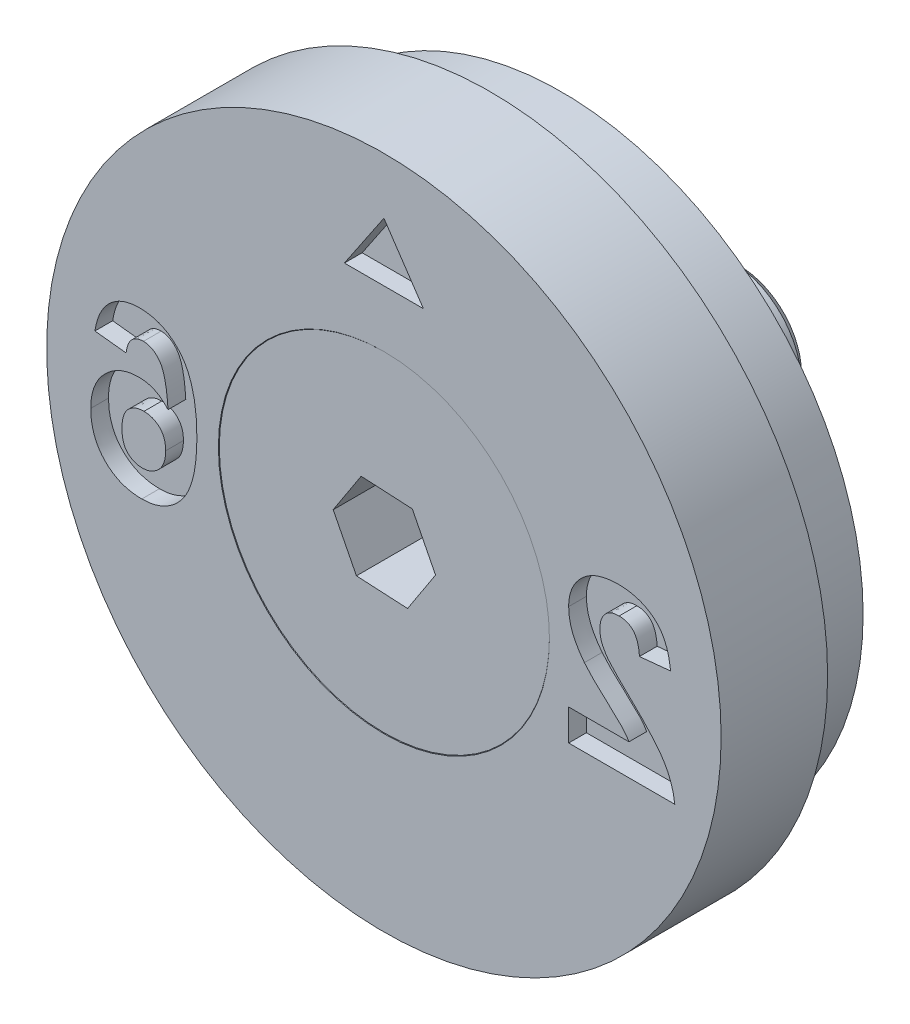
ISO-10303-21;
HEADER;
FILE_DESCRIPTION(('STEP AP214'),'2;1');
FILE_NAME('part.step','',(''),(''),'','','');
FILE_SCHEMA(('AUTOMOTIVE_DESIGN { 1 0 10303 214 1 1 1 1 }'));
ENDSEC;
DATA;
#1=APPLICATION_CONTEXT('core data for automotive mechanical design processes');
#2=APPLICATION_PROTOCOL_DEFINITION('international standard','automotive_design',2000,#1);
#3=PRODUCT_CONTEXT('',#1,'mechanical');
#4=PRODUCT('Part','Part','',(#3));
#5=PRODUCT_RELATED_PRODUCT_CATEGORY('part','',(#4));
#6=PRODUCT_DEFINITION_FORMATION('','',#4);
#7=PRODUCT_DEFINITION_CONTEXT('part definition',#1,'design');
#8=PRODUCT_DEFINITION('design','',#6,#7);
#9=PRODUCT_DEFINITION_SHAPE('','',#8);
#10=(LENGTH_UNIT() NAMED_UNIT(*) SI_UNIT(.MILLI.,.METRE.));
#11=(NAMED_UNIT(*) PLANE_ANGLE_UNIT() SI_UNIT($,.RADIAN.));
#12=(NAMED_UNIT(*) SI_UNIT($,.STERADIAN.) SOLID_ANGLE_UNIT());
#13=UNCERTAINTY_MEASURE_WITH_UNIT(LENGTH_MEASURE(1.E-05),#10,'distance_accuracy_value','');
#14=(GEOMETRIC_REPRESENTATION_CONTEXT(3) GLOBAL_UNCERTAINTY_ASSIGNED_CONTEXT((#13)) GLOBAL_UNIT_ASSIGNED_CONTEXT((#10,
#11,#12)) REPRESENTATION_CONTEXT('',''));
#15=CARTESIAN_POINT('',(0.,0.,0.));
#16=DIRECTION('',(0.,0.,1.));
#17=DIRECTION('',(1.,0.,0.));
#18=AXIS2_PLACEMENT_3D('',#15,#16,#17);
#19=CARTESIAN_POINT('',(0.,0.,-0.0130000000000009));
#20=DIRECTION('',(0.,0.,1.));
#21=DIRECTION('',(1.,0.,0.));
#22=AXIS2_PLACEMENT_3D('',#19,#20,#21);
#23=CYLINDRICAL_SURFACE('',#22,2.);
#24=CARTESIAN_POINT('',(0.,0.,-2.663));
#25=DIRECTION('',(0.,0.,1.));
#26=DIRECTION('',(1.,0.,0.));
#27=AXIS2_PLACEMENT_3D('',#24,#25,#26);
#28=CIRCLE('',#27,2.);
#29=CARTESIAN_POINT('',(2.,0.,-2.663));
#30=VERTEX_POINT('',#29);
#31=EDGE_CURVE('E12',#30,#30,#28,.T.);
#32=ORIENTED_EDGE('',*,*,#31,.F.);
#33=EDGE_LOOP('',(#32));
#34=FACE_BOUND('',#33,.T.);
#35=CARTESIAN_POINT('',(0.,0.,-9.763));
#36=DIRECTION('',(0.,0.,1.));
#37=DIRECTION('',(1.,0.,0.));
#38=AXIS2_PLACEMENT_3D('',#35,#36,#37);
#39=CIRCLE('',#38,2.);
#40=CARTESIAN_POINT('',(2.,0.,-9.763));
#41=VERTEX_POINT('',#40);
#42=EDGE_CURVE('E150',#41,#41,#39,.T.);
#43=ORIENTED_EDGE('',*,*,#42,.T.);
#44=EDGE_LOOP('',(#43));
#45=FACE_BOUND('',#44,.T.);
#46=ADVANCED_FACE('F49',(#34,#45),#23,.T.);
#47=CARTESIAN_POINT('',(0.,0.,-2.663));
#48=DIRECTION('',(0.,0.,1.));
#49=DIRECTION('',(1.,0.,0.));
#50=AXIS2_PLACEMENT_3D('',#47,#48,#49);
#51=CONICAL_SURFACE('',#50,2.,0.785398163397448);
#52=CARTESIAN_POINT('',(0.,0.,-0.0130000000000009));
#53=DIRECTION('',(0.,0.,1.));
#54=DIRECTION('',(1.,0.,0.));
#55=AXIS2_PLACEMENT_3D('',#52,#53,#54);
#56=CIRCLE('',#55,4.65);
#57=CARTESIAN_POINT('',(4.65,0.,-0.0130000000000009));
#58=VERTEX_POINT('',#57);
#59=EDGE_CURVE('E56',#58,#58,#56,.T.);
#60=ORIENTED_EDGE('',*,*,#59,.F.);
#61=EDGE_LOOP('',(#60));
#62=FACE_BOUND('',#61,.T.);
#63=ORIENTED_EDGE('',*,*,#31,.T.);
#64=EDGE_LOOP('',(#63));
#65=FACE_BOUND('',#64,.T.);
#66=ADVANCED_FACE('F165',(#62,#65),#51,.T.);
#67=CARTESIAN_POINT('',(0.,4.65,-0.0130000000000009));
#68=DIRECTION('',(0.,0.,-1.));
#69=DIRECTION('',(-1.,0.,0.));
#70=AXIS2_PLACEMENT_3D('',#67,#68,#69);
#71=PLANE('',#70);
#72=DIRECTION('',(0.99860351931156,-0.0528300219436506,0.));
#73=VECTOR('',#72,1.);
#74=CARTESIAN_POINT('',(-0.786717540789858,-1.21012761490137,-0.0130000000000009));
#75=LINE('',#74,#73);
#76=CARTESIAN_POINT('',(-0.786717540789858,-1.21012761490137,-0.0130000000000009));
#77=VERTEX_POINT('',#76);
#78=CARTESIAN_POINT('',(0.654642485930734,-1.28638118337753,-0.0130000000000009));
#79=VERTEX_POINT('',#78);
#80=EDGE_CURVE('E137',#77,#79,#75,.T.);
#81=ORIENTED_EDGE('',*,*,#80,.F.);
#82=DIRECTION('',(0.453549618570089,-0.891231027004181,0.));
#83=VECTOR('',#82,1.);
#84=CARTESIAN_POINT('',(-1.44136002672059,0.076253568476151,-0.0130000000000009));
#85=LINE('',#84,#83);
#86=CARTESIAN_POINT('',(-1.44136002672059,0.076253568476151,-0.0130000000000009));
#87=VERTEX_POINT('',#86);
#88=EDGE_CURVE('E63',#87,#77,#85,.T.);
#89=ORIENTED_EDGE('',*,*,#88,.F.);
#90=DIRECTION('',(-0.545053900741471,-0.83840100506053,0.));
#91=VECTOR('',#90,1.);
#92=CARTESIAN_POINT('',(-0.654642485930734,1.28638118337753,-0.0130000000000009));
#93=LINE('',#92,#91);
#94=CARTESIAN_POINT('',(-0.654642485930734,1.28638118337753,-0.0130000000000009));
#95=VERTEX_POINT('',#94);
#96=EDGE_CURVE('E146',#95,#87,#93,.T.);
#97=ORIENTED_EDGE('',*,*,#96,.F.);
#98=DIRECTION('',(-0.99860351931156,0.0528300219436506,0.));
#99=VECTOR('',#98,1.);
#100=CARTESIAN_POINT('',(0.786717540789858,1.21012761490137,-0.0130000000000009));
#101=LINE('',#100,#99);
#102=CARTESIAN_POINT('',(0.786717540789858,1.21012761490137,-0.0130000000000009));
#103=VERTEX_POINT('',#102);
#104=EDGE_CURVE('E144',#103,#95,#101,.T.);
#105=ORIENTED_EDGE('',*,*,#104,.F.);
#106=DIRECTION('',(-0.45354961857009,0.891231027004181,0.));
#107=VECTOR('',#106,1.);
#108=CARTESIAN_POINT('',(1.44136002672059,-0.0762535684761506,-0.0130000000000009));
#109=LINE('',#108,#107);
#110=CARTESIAN_POINT('',(1.44136002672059,-0.0762535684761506,-0.0130000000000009));
#111=VERTEX_POINT('',#110);
#112=EDGE_CURVE('E111',#111,#103,#109,.T.);
#113=ORIENTED_EDGE('',*,*,#112,.F.);
#114=DIRECTION('',(0.545053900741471,0.83840100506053,0.));
#115=VECTOR('',#114,1.);
#116=CARTESIAN_POINT('',(0.654642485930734,-1.28638118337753,-0.0130000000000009));
#117=LINE('',#116,#115);
#118=EDGE_CURVE('E140',#79,#111,#117,.T.);
#119=ORIENTED_EDGE('',*,*,#118,.F.);
#120=EDGE_LOOP('',(#81,#89,#97,#105,#113,#119));
#121=FACE_BOUND('',#120,.T.);
#122=ORIENTED_EDGE('',*,*,#59,.T.);
#123=EDGE_LOOP('',(#122));
#124=FACE_BOUND('',#123,.T.);
#125=ADVANCED_FACE('F163',(#121,#124),#71,.F.);
#126=CARTESIAN_POINT('',(0.,0.,-10.013));
#127=DIRECTION('',(0.,0.,1.));
#128=DIRECTION('',(1.,0.,0.));
#129=AXIS2_PLACEMENT_3D('',#126,#127,#128);
#130=PLANE('',#129);
#131=CARTESIAN_POINT('',(0.,0.,-10.013));
#132=DIRECTION('',(0.,0.,1.));
#133=DIRECTION('',(1.,0.,0.));
#134=AXIS2_PLACEMENT_3D('',#131,#132,#133);
#135=CIRCLE('',#134,1.75);
#136=CARTESIAN_POINT('',(1.75,0.,-10.013));
#137=VERTEX_POINT('',#136);
#138=EDGE_CURVE('E158',#137,#137,#135,.T.);
#139=ORIENTED_EDGE('',*,*,#138,.F.);
#140=EDGE_LOOP('',(#139));
#141=FACE_BOUND('',#140,.T.);
#142=ADVANCED_FACE('F178',(#141),#130,.F.);
#143=CARTESIAN_POINT('',(0.,0.,-10.013));
#144=DIRECTION('',(0.,0.,1.));
#145=DIRECTION('',(1.,0.,0.));
#146=AXIS2_PLACEMENT_3D('',#143,#144,#145);
#147=CONICAL_SURFACE('',#146,1.75,0.78539816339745);
#148=ORIENTED_EDGE('',*,*,#42,.F.);
#149=EDGE_LOOP('',(#148));
#150=FACE_BOUND('',#149,.T.);
#151=ORIENTED_EDGE('',*,*,#138,.T.);
#152=EDGE_LOOP('',(#151));
#153=FACE_BOUND('',#152,.T.);
#154=ADVANCED_FACE('F174',(#150,#153),#147,.T.);
#155=CARTESIAN_POINT('',(-1.44136002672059,0.076253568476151,-2.013));
#156=DIRECTION('',(-0.891231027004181,-0.453549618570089,0.));
#157=DIRECTION('',(0.453549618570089,-0.891231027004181,0.));
#158=AXIS2_PLACEMENT_3D('',#155,#156,#157);
#159=PLANE('',#158);
#160=ORIENTED_EDGE('',*,*,#88,.T.);
#161=DIRECTION('',(0.,0.,1.));
#162=VECTOR('',#161,1.);
#163=CARTESIAN_POINT('',(-0.786717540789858,-1.21012761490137,-2.013));
#164=LINE('',#163,#162);
#165=CARTESIAN_POINT('',(-0.786717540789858,-1.21012761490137,-2.013));
#166=VERTEX_POINT('',#165);
#167=EDGE_CURVE('E93',#166,#77,#164,.T.);
#168=ORIENTED_EDGE('',*,*,#167,.F.);
#169=DIRECTION('',(0.453549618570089,-0.891231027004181,0.));
#170=VECTOR('',#169,1.);
#171=CARTESIAN_POINT('',(-1.44136002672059,0.076253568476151,-2.013));
#172=LINE('',#171,#170);
#173=CARTESIAN_POINT('',(-1.44136002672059,0.076253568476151,-2.013));
#174=VERTEX_POINT('',#173);
#175=EDGE_CURVE('E148',#174,#166,#172,.T.);
#176=ORIENTED_EDGE('',*,*,#175,.F.);
#177=DIRECTION('',(0.,0.,1.));
#178=VECTOR('',#177,1.);
#179=CARTESIAN_POINT('',(-1.44136002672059,0.076253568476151,-2.013));
#180=LINE('',#179,#178);
#181=EDGE_CURVE('E71',#174,#87,#180,.T.);
#182=ORIENTED_EDGE('',*,*,#181,.T.);
#183=EDGE_LOOP('',(#160,#168,#176,#182));
#184=FACE_BOUND('',#183,.T.);
#185=ADVANCED_FACE('F177',(#184),#159,.F.);
#186=CARTESIAN_POINT('',(-0.654642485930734,1.28638118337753,-2.013));
#187=DIRECTION('',(-0.83840100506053,0.545053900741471,0.));
#188=DIRECTION('',(-0.54505390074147,-0.83840100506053,0.));
#189=AXIS2_PLACEMENT_3D('',#186,#187,#188);
#190=PLANE('',#189);
#191=ORIENTED_EDGE('',*,*,#96,.T.);
#192=ORIENTED_EDGE('',*,*,#181,.F.);
#193=DIRECTION('',(-0.545053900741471,-0.83840100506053,0.));
#194=VECTOR('',#193,1.);
#195=CARTESIAN_POINT('',(-0.654642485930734,1.28638118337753,-2.013));
#196=LINE('',#195,#194);
#197=CARTESIAN_POINT('',(-0.654642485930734,1.28638118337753,-2.013));
#198=VERTEX_POINT('',#197);
#199=EDGE_CURVE('E123',#198,#174,#196,.T.);
#200=ORIENTED_EDGE('',*,*,#199,.F.);
#201=DIRECTION('',(0.,0.,1.));
#202=VECTOR('',#201,1.);
#203=CARTESIAN_POINT('',(-0.654642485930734,1.28638118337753,-2.013));
#204=LINE('',#203,#202);
#205=EDGE_CURVE('E115',#198,#95,#204,.T.);
#206=ORIENTED_EDGE('',*,*,#205,.T.);
#207=EDGE_LOOP('',(#191,#192,#200,#206));
#208=FACE_BOUND('',#207,.T.);
#209=ADVANCED_FACE('F192',(#208),#190,.F.);
#210=CARTESIAN_POINT('',(0.786717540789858,1.21012761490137,-2.013));
#211=DIRECTION('',(0.0528300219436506,0.99860351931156,0.));
#212=DIRECTION('',(-0.99860351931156,0.0528300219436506,0.));
#213=AXIS2_PLACEMENT_3D('',#210,#211,#212);
#214=PLANE('',#213);
#215=ORIENTED_EDGE('',*,*,#104,.T.);
#216=ORIENTED_EDGE('',*,*,#205,.F.);
#217=DIRECTION('',(-0.99860351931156,0.0528300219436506,0.));
#218=VECTOR('',#217,1.);
#219=CARTESIAN_POINT('',(0.786717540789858,1.21012761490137,-2.013));
#220=LINE('',#219,#218);
#221=CARTESIAN_POINT('',(0.786717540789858,1.21012761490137,-2.013));
#222=VERTEX_POINT('',#221);
#223=EDGE_CURVE('E119',#222,#198,#220,.T.);
#224=ORIENTED_EDGE('',*,*,#223,.F.);
#225=DIRECTION('',(0.,0.,1.));
#226=VECTOR('',#225,1.);
#227=CARTESIAN_POINT('',(0.786717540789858,1.21012761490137,-2.013));
#228=LINE('',#227,#226);
#229=EDGE_CURVE('E104',#222,#103,#228,.T.);
#230=ORIENTED_EDGE('',*,*,#229,.T.);
#231=EDGE_LOOP('',(#215,#216,#224,#230));
#232=FACE_BOUND('',#231,.T.);
#233=ADVANCED_FACE('F120',(#232),#214,.F.);
#234=CARTESIAN_POINT('',(1.44136002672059,-0.0762535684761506,-2.013));
#235=DIRECTION('',(0.89123102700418,0.45354961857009,0.));
#236=DIRECTION('',(-0.45354961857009,0.891231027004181,0.));
#237=AXIS2_PLACEMENT_3D('',#234,#235,#236);
#238=PLANE('',#237);
#239=ORIENTED_EDGE('',*,*,#112,.T.);
#240=ORIENTED_EDGE('',*,*,#229,.F.);
#241=DIRECTION('',(-0.45354961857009,0.891231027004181,0.));
#242=VECTOR('',#241,1.);
#243=CARTESIAN_POINT('',(1.44136002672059,-0.0762535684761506,-2.013));
#244=LINE('',#243,#242);
#245=CARTESIAN_POINT('',(1.44136002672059,-0.0762535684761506,-2.013));
#246=VERTEX_POINT('',#245);
#247=EDGE_CURVE('E108',#246,#222,#244,.T.);
#248=ORIENTED_EDGE('',*,*,#247,.F.);
#249=DIRECTION('',(0.,0.,1.));
#250=VECTOR('',#249,1.);
#251=CARTESIAN_POINT('',(1.44136002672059,-0.0762535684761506,-2.013));
#252=LINE('',#251,#250);
#253=EDGE_CURVE('E116',#246,#111,#252,.T.);
#254=ORIENTED_EDGE('',*,*,#253,.T.);
#255=EDGE_LOOP('',(#239,#240,#248,#254));
#256=FACE_BOUND('',#255,.T.);
#257=ADVANCED_FACE('F106',(#256),#238,.F.);
#258=CARTESIAN_POINT('',(0.654642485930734,-1.28638118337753,-2.013));
#259=DIRECTION('',(0.83840100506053,-0.545053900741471,0.));
#260=DIRECTION('',(0.54505390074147,0.83840100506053,0.));
#261=AXIS2_PLACEMENT_3D('',#258,#259,#260);
#262=PLANE('',#261);
#263=ORIENTED_EDGE('',*,*,#118,.T.);
#264=ORIENTED_EDGE('',*,*,#253,.F.);
#265=DIRECTION('',(0.545053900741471,0.83840100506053,0.));
#266=VECTOR('',#265,1.);
#267=CARTESIAN_POINT('',(0.654642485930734,-1.28638118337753,-2.013));
#268=LINE('',#267,#266);
#269=CARTESIAN_POINT('',(0.654642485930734,-1.28638118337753,-2.013));
#270=VERTEX_POINT('',#269);
#271=EDGE_CURVE('E129',#270,#246,#268,.T.);
#272=ORIENTED_EDGE('',*,*,#271,.F.);
#273=DIRECTION('',(0.,0.,1.));
#274=VECTOR('',#273,1.);
#275=CARTESIAN_POINT('',(0.654642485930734,-1.28638118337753,-2.013));
#276=LINE('',#275,#274);
#277=EDGE_CURVE('E153',#270,#79,#276,.T.);
#278=ORIENTED_EDGE('',*,*,#277,.T.);
#279=EDGE_LOOP('',(#263,#264,#272,#278));
#280=FACE_BOUND('',#279,.T.);
#281=ADVANCED_FACE('F196',(#280),#262,.F.);
#282=CARTESIAN_POINT('',(-0.786717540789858,-1.21012761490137,-2.013));
#283=DIRECTION('',(-0.0528300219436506,-0.99860351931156,0.));
#284=DIRECTION('',(0.99860351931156,-0.0528300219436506,0.));
#285=AXIS2_PLACEMENT_3D('',#282,#283,#284);
#286=PLANE('',#285);
#287=ORIENTED_EDGE('',*,*,#80,.T.);
#288=ORIENTED_EDGE('',*,*,#277,.F.);
#289=DIRECTION('',(0.99860351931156,-0.0528300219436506,0.));
#290=VECTOR('',#289,1.);
#291=CARTESIAN_POINT('',(-0.786717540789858,-1.21012761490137,-2.013));
#292=LINE('',#291,#290);
#293=EDGE_CURVE('E131',#166,#270,#292,.T.);
#294=ORIENTED_EDGE('',*,*,#293,.F.);
#295=ORIENTED_EDGE('',*,*,#167,.T.);
#296=EDGE_LOOP('',(#287,#288,#294,#295));
#297=FACE_BOUND('',#296,.T.);
#298=ADVANCED_FACE('F193',(#297),#286,.F.);
#299=CARTESIAN_POINT('',(0.,0.,-2.013));
#300=DIRECTION('',(0.,0.,1.));
#301=DIRECTION('',(1.,0.,0.));
#302=AXIS2_PLACEMENT_3D('',#299,#300,#301);
#303=PLANE('',#302);
#304=ORIENTED_EDGE('',*,*,#175,.T.);
#305=ORIENTED_EDGE('',*,*,#293,.T.);
#306=ORIENTED_EDGE('',*,*,#271,.T.);
#307=ORIENTED_EDGE('',*,*,#247,.T.);
#308=ORIENTED_EDGE('',*,*,#223,.T.);
#309=ORIENTED_EDGE('',*,*,#199,.T.);
#310=EDGE_LOOP('',(#304,#305,#306,#307,#308,#309));
#311=FACE_BOUND('',#310,.T.);
#312=ADVANCED_FACE('F126',(#311),#303,.T.);
#313=CLOSED_SHELL('',(#46,#66,#125,#142,#154,#185,#209,#233,#257,#281,#298,#312));
#314=MANIFOLD_SOLID_BREP('B2',#313);
#315=CARTESIAN_POINT('',(0.,9.5,0.));
#316=DIRECTION('',(0.,0.,-1.));
#317=DIRECTION('',(-1.,0.,0.));
#318=AXIS2_PLACEMENT_3D('',#315,#316,#317);
#319=PLANE('',#318);
#320=DIRECTION('',(0.,-1.,0.));
#321=VECTOR('',#320,1.);
#322=CARTESIAN_POINT('',(5.20476471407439,-1.40676923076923,0.));
#323=LINE('',#322,#321);
#324=CARTESIAN_POINT('',(5.20476471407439,-1.40676923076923,0.));
#325=VERTEX_POINT('',#324);
#326=CARTESIAN_POINT('',(5.20476471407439,-2.286,0.));
#327=VERTEX_POINT('',#326);
#328=EDGE_CURVE('E694',#325,#327,#323,.T.);
#329=ORIENTED_EDGE('',*,*,#328,.F.);
#330=DIRECTION('',(-1.,0.,0.));
#331=VECTOR('',#330,1.);
#332=CARTESIAN_POINT('',(6.90369500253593,-1.40676923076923,0.));
#333=LINE('',#332,#331);
#334=CARTESIAN_POINT('',(6.90369500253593,-1.40676923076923,0.));
#335=VERTEX_POINT('',#334);
#336=EDGE_CURVE('E323',#335,#325,#333,.T.);
#337=ORIENTED_EDGE('',*,*,#336,.F.);
#338=CARTESIAN_POINT('',(5.64804356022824,-0.104408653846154,0.));
#339=CARTESIAN_POINT('',(5.66194972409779,-0.121923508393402,0.));
#340=CARTESIAN_POINT('',(5.69173350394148,-0.159436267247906,0.));
#341=CARTESIAN_POINT('',(5.74240354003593,-0.216956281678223,0.));
#342=CARTESIAN_POINT('',(5.80112575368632,-0.279786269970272,0.));
#343=CARTESIAN_POINT('',(5.86707071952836,-0.349102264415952,0.));
#344=CARTESIAN_POINT('',(5.94241672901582,-0.422449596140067,0.));
#345=CARTESIAN_POINT('',(6.02445282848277,-0.502895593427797,0.));
#346=CARTESIAN_POINT('',(6.11678884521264,-0.586325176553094,0.));
#347=CARTESIAN_POINT('',(6.21242658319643,-0.674819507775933,0.));
#348=CARTESIAN_POINT('',(6.30848002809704,-0.760949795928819,0.));
#349=CARTESIAN_POINT('',(6.3967669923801,-0.842754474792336,0.));
#350=CARTESIAN_POINT('',(6.47696093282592,-0.915134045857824,0.));
#351=CARTESIAN_POINT('',(6.54532706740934,-0.982084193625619,0.));
#352=CARTESIAN_POINT('',(6.60588667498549,-1.03903561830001,0.));
#353=CARTESIAN_POINT('',(6.65645698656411,-1.08890872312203,0.));
#354=CARTESIAN_POINT('',(6.69798429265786,-1.13049612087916,0.));
#355=CARTESIAN_POINT('',(6.75520624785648,-1.19532032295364,0.));
#356=CARTESIAN_POINT('',(6.82801469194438,-1.28299508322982,0.));
#357=CARTESIAN_POINT('',(6.87923840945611,-1.36677079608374,0.));
#358=CARTESIAN_POINT('',(6.90369500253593,-1.40676923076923,0.));
#359=B_SPLINE_CURVE_WITH_KNOTS('',3,(#338,#339,#340,#341,#342,#343,#344,#345,#346,#347,#348,
#349,#350,#351,#352,#353,#354,#355,#356,#357,#358),.UNSPECIFIED.,.F.,.F.,(4,1,1,1,1,1,1,1,1,1,1,
1,1,1,1,1,1,1,4),(0.,0.0369753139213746,0.0791925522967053,0.126700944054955,0.179184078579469,
0.237368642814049,0.300558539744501,0.369153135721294,0.443112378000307,0.516018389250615,
0.582473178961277,0.642136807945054,0.694619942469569,0.740679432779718,0.779589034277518,
0.812073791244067,0.837814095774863,0.922564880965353,1.),.UNSPECIFIED.);
#360=CARTESIAN_POINT('',(5.64804356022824,-0.104408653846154,0.));
#361=VERTEX_POINT('',#360);
#362=EDGE_CURVE('E520',#361,#335,#359,.T.);
#363=ORIENTED_EDGE('',*,*,#362,.F.);
#364=CARTESIAN_POINT('',(5.20476471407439,1.04225480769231,0.));
#365=CARTESIAN_POINT('',(5.20588330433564,0.992417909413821,0.));
#366=CARTESIAN_POINT('',(5.20810241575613,0.893549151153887,0.));
#367=CARTESIAN_POINT('',(5.2293487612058,0.747391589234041,0.));
#368=CARTESIAN_POINT('',(5.2618090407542,0.604604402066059,0.));
#369=CARTESIAN_POINT('',(5.30978277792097,0.464838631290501,0.));
#370=CARTESIAN_POINT('',(5.37059321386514,0.324741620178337,0.));
#371=CARTESIAN_POINT('',(5.44897932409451,0.183998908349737,0.));
#372=CARTESIAN_POINT('',(5.53999152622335,0.0383659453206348,0.));
#373=CARTESIAN_POINT('',(5.61125049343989,-0.0557921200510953,0.));
#374=CARTESIAN_POINT('',(5.64804356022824,-0.104408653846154,0.));
#375=B_SPLINE_CURVE_WITH_KNOTS('',3,(#364,#365,#366,#367,#368,#369,#370,#371,#372,#373,#374),
.UNSPECIFIED.,.F.,.F.,(4,1,1,1,1,1,1,1,4),(0.,0.119176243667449,0.236427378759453,
0.352663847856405,0.469086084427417,0.589462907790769,0.717601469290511,0.854189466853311,1.),.UNSPECIFIED.);
#376=CARTESIAN_POINT('',(5.20476471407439,1.04225480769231,0.));
#377=VERTEX_POINT('',#376);
#378=EDGE_CURVE('E523',#377,#361,#375,.T.);
#379=ORIENTED_EDGE('',*,*,#378,.F.);
#380=CARTESIAN_POINT('',(6.60787048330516,2.286,0.));
#381=CARTESIAN_POINT('',(6.55471095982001,2.28497830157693,0.));
#382=CARTESIAN_POINT('',(6.45117611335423,2.28298841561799,0.));
#383=CARTESIAN_POINT('',(6.30003361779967,2.26655592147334,0.));
#384=CARTESIAN_POINT('',(6.15804610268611,2.23790348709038,0.));
#385=CARTESIAN_POINT('',(6.02397221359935,2.19994928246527,0.));
#386=CARTESIAN_POINT('',(5.89918881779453,2.14927764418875,0.));
#387=CARTESIAN_POINT('',(5.78265609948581,2.08801774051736,0.));
#388=CARTESIAN_POINT('',(5.67620807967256,2.01384463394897,0.));
#389=CARTESIAN_POINT('',(5.57825800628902,1.93080329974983,0.));
#390=CARTESIAN_POINT('',(5.49069847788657,1.8394847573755,0.));
#391=CARTESIAN_POINT('',(5.41400425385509,1.74207809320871,0.));
#392=CARTESIAN_POINT('',(5.34975008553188,1.63865117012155,0.));
#393=CARTESIAN_POINT('',(5.29583097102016,1.53046464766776,0.));
#394=CARTESIAN_POINT('',(5.25579639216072,1.41577764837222,0.));
#395=CARTESIAN_POINT('',(5.22662545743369,1.29617597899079,0.));
#396=CARTESIAN_POINT('',(5.20728395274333,1.17110167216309,0.));
#397=CARTESIAN_POINT('',(5.20561374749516,1.0856787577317,0.));
#398=CARTESIAN_POINT('',(5.20476471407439,1.04225480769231,0.));
#399=B_SPLINE_CURVE_WITH_KNOTS('',3,(#380,#381,#382,#383,#384,#385,#386,#387,#388,#389,#390,
#391,#392,#393,#394,#395,#396,#397,#398),.UNSPECIFIED.,.F.,.F.,(4,1,1,1,1,1,1,1,1,1,1,1,1,1,1,1,
4),(0.,0.0756723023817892,0.147381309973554,0.216084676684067,0.281698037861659,
0.345459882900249,0.407485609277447,0.46873129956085,0.529782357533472,0.590032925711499,
0.648548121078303,0.70595351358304,0.763101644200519,0.820289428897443,0.878479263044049,
0.938226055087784,1.),.UNSPECIFIED.);
#400=CARTESIAN_POINT('',(6.60787048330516,2.286,0.));
#401=VERTEX_POINT('',#400);
#402=EDGE_CURVE('E1332',#401,#377,#399,.T.);
#403=ORIENTED_EDGE('',*,*,#402,.F.);
#404=CARTESIAN_POINT('',(8.07691856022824,0.906706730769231,0.));
#405=CARTESIAN_POINT('',(8.06984968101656,0.966065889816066,0.));
#406=CARTESIAN_POINT('',(8.05614425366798,1.08115381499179,0.));
#407=CARTESIAN_POINT('',(8.02194212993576,1.24645975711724,0.));
#408=CARTESIAN_POINT('',(7.97862640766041,1.39896195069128,0.));
#409=CARTESIAN_POINT('',(7.92413208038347,1.5383773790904,0.));
#410=CARTESIAN_POINT('',(7.86071146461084,1.66559258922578,0.));
#411=CARTESIAN_POINT('',(7.78512958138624,1.778698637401,0.));
#412=CARTESIAN_POINT('',(7.70002734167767,1.8789484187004,0.));
#413=CARTESIAN_POINT('',(7.60533119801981,1.96628857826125,0.));
#414=CARTESIAN_POINT('',(7.5016431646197,2.04099696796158,0.));
#415=CARTESIAN_POINT('',(7.39284117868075,2.1076856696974,0.));
#416=CARTESIAN_POINT('',(7.27679894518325,2.1623916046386,0.));
#417=CARTESIAN_POINT('',(7.15479409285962,2.207477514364,0.));
#418=CARTESIAN_POINT('',(7.02688175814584,2.24350981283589,0.));
#419=CARTESIAN_POINT('',(6.89247032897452,2.2673338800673,0.));
#420=CARTESIAN_POINT('',(6.75238934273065,2.28409182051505,0.));
#421=CARTESIAN_POINT('',(6.65676947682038,2.2853543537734,0.));
#422=CARTESIAN_POINT('',(6.60787048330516,2.286,0.));
#423=B_SPLINE_CURVE_WITH_KNOTS('',3,(#404,#405,#406,#407,#408,#409,#410,#411,#412,#413,#414,
#415,#416,#417,#418,#419,#420,#421,#422),.UNSPECIFIED.,.F.,.F.,(4,1,1,1,1,1,1,1,1,1,1,1,1,1,1,1,
4),(0.,0.0794357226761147,0.154013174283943,0.224141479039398,0.289934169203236,
0.352732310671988,0.412725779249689,0.470302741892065,0.527168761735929,0.583502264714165,
0.639948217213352,0.696584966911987,0.753726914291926,0.812707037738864,0.872963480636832,
0.93503486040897,1.),.UNSPECIFIED.);
#424=CARTESIAN_POINT('',(8.07691856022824,0.906706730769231,0.));
#425=VERTEX_POINT('',#424);
#426=EDGE_CURVE('E1327',#425,#401,#423,.T.);
#427=ORIENTED_EDGE('',*,*,#426,.F.);
#428=DIRECTION('',(0.995240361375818,0.0974506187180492,0.));
#429=VECTOR('',#428,1.);
#430=CARTESIAN_POINT('',(7.19768779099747,0.820615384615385,0.));
#431=LINE('',#430,#429);
#432=CARTESIAN_POINT('',(7.19768779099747,0.820615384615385,0.));
#433=VERTEX_POINT('',#432);
#434=EDGE_CURVE('E1321',#433,#425,#431,.T.);
#435=ORIENTED_EDGE('',*,*,#434,.F.);
#436=CARTESIAN_POINT('',(6.62618779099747,1.524,0.));
#437=CARTESIAN_POINT('',(6.66606585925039,1.52219327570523,0.));
#438=CARTESIAN_POINT('',(6.74310167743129,1.51870307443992,0.));
#439=CARTESIAN_POINT('',(6.85258628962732,1.48821315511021,0.));
#440=CARTESIAN_POINT('',(6.94836511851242,1.43543189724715,0.));
#441=CARTESIAN_POINT('',(7.01662220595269,1.37528256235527,0.));
#442=CARTESIAN_POINT('',(7.06273310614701,1.3167917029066,0.));
#443=CARTESIAN_POINT('',(7.09415146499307,1.26582077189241,0.));
#444=CARTESIAN_POINT('',(7.12123163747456,1.20790216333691,0.));
#445=CARTESIAN_POINT('',(7.14522692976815,1.14368794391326,0.));
#446=CARTESIAN_POINT('',(7.16418049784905,1.07244247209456,0.));
#447=CARTESIAN_POINT('',(7.17944452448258,0.994708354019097,0.));
#448=CARTESIAN_POINT('',(7.19174512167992,0.910067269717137,0.));
#449=CARTESIAN_POINT('',(7.19565692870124,0.851184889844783,0.));
#450=CARTESIAN_POINT('',(7.19768779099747,0.820615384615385,0.));
#451=B_SPLINE_CURVE_WITH_KNOTS('',3,(#436,#437,#438,#439,#440,#441,#442,#443,#444,#445,#446,
#447,#448,#449,#450),.UNSPECIFIED.,.F.,.F.,(4,1,1,1,1,1,1,1,1,1,1,1,4),(0.,0.116899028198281,
0.225823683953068,0.330086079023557,0.43545148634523,0.490306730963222,0.548244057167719,
0.610766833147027,0.677675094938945,0.749188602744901,0.826858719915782,0.910111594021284,1.),.UNSPECIFIED.);
#452=CARTESIAN_POINT('',(6.62618779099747,1.524,0.));
#453=VERTEX_POINT('',#452);
#454=EDGE_CURVE('E1301',#453,#433,#451,.T.);
#455=ORIENTED_EDGE('',*,*,#454,.F.);
#456=CARTESIAN_POINT('',(6.08399548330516,0.924108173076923,0.));
#457=CARTESIAN_POINT('',(6.08564216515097,0.969724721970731,0.));
#458=CARTESIAN_POINT('',(6.08875755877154,1.05602767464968,0.));
#459=CARTESIAN_POINT('',(6.11488067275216,1.1778170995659,0.));
#460=CARTESIAN_POINT('',(6.16120577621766,1.28251236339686,0.));
#461=CARTESIAN_POINT('',(6.22498691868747,1.3704348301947,0.));
#462=CARTESIAN_POINT('',(6.30563830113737,1.43932174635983,0.));
#463=CARTESIAN_POINT('',(6.39992211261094,1.49022249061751,0.));
#464=CARTESIAN_POINT('',(6.50921851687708,1.51836396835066,0.));
#465=CARTESIAN_POINT('',(6.58603847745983,1.52206545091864,0.));
#466=CARTESIAN_POINT('',(6.62618779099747,1.524,0.));
#467=B_SPLINE_CURVE_WITH_KNOTS('',3,(#456,#457,#458,#459,#460,#461,#462,#463,#464,#465,#466),
.UNSPECIFIED.,.F.,.F.,(4,1,1,1,1,1,1,1,4),(0.,0.149140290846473,0.282161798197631,
0.404655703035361,0.521109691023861,0.634416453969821,0.748796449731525,0.868710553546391,1.),.UNSPECIFIED.);
#468=CARTESIAN_POINT('',(6.08399548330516,0.924108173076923,0.));
#469=VERTEX_POINT('',#468);
#470=EDGE_CURVE('E1299',#469,#453,#467,.T.);
#471=ORIENTED_EDGE('',*,*,#470,.F.);
#472=CARTESIAN_POINT('',(6.25800990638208,0.395653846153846,0.));
#473=CARTESIAN_POINT('',(6.23153825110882,0.439626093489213,0.));
#474=CARTESIAN_POINT('',(6.18047749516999,0.524443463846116,0.));
#475=CARTESIAN_POINT('',(6.12448514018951,0.657820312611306,0.));
#476=CARTESIAN_POINT('',(6.09087644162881,0.791169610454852,0.));
#477=CARTESIAN_POINT('',(6.08626441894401,0.880272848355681,0.));
#478=CARTESIAN_POINT('',(6.08399548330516,0.924108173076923,0.));
#479=B_SPLINE_CURVE_WITH_KNOTS('',3,(#472,#473,#474,#475,#476,#477,#478),.UNSPECIFIED.,.F.,.F.,
(4,1,1,1,4),(0.,0.272795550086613,0.526191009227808,0.766904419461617,1.),.UNSPECIFIED.);
#480=CARTESIAN_POINT('',(6.25800990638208,0.395653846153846,0.));
#481=VERTEX_POINT('',#480);
#482=EDGE_CURVE('E1292',#481,#469,#479,.T.);
#483=ORIENTED_EDGE('',*,*,#482,.F.);
#484=CARTESIAN_POINT('',(6.95773106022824,-0.342533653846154,0.));
#485=CARTESIAN_POINT('',(6.91252756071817,-0.2988999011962,0.));
#486=CARTESIAN_POINT('',(6.82647341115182,-0.215834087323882,0.));
#487=CARTESIAN_POINT('',(6.70393213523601,-0.0968872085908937,0.));
#488=CARTESIAN_POINT('',(6.5962057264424,0.0124587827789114,0.));
#489=CARTESIAN_POINT('',(6.50104177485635,0.109370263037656,0.));
#490=CARTESIAN_POINT('',(6.42063870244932,0.196314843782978,0.));
#491=CARTESIAN_POINT('',(6.35393888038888,0.271927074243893,0.));
#492=CARTESIAN_POINT('',(6.30009756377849,0.336514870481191,0.));
#493=CARTESIAN_POINT('',(6.27093705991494,0.377489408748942,0.));
#494=CARTESIAN_POINT('',(6.25800990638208,0.395653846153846,0.));
#495=B_SPLINE_CURVE_WITH_KNOTS('',3,(#484,#485,#486,#487,#488,#489,#490,#491,#492,#493,#494),
.UNSPECIFIED.,.F.,.F.,(4,1,1,1,1,1,1,1,4),(0.,0.185090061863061,0.352356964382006,
0.503079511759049,0.637279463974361,0.752473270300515,0.851885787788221,0.934339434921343,1.),.UNSPECIFIED.);
#496=CARTESIAN_POINT('',(6.95773106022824,-0.342533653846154,0.));
#497=VERTEX_POINT('',#496);
#498=EDGE_CURVE('E1284',#497,#481,#495,.T.);
#499=ORIENTED_EDGE('',*,*,#498,.F.);
#500=CARTESIAN_POINT('',(8.19414932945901,-2.286,0.));
#501=CARTESIAN_POINT('',(8.1840279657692,-2.21085697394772,0.));
#502=CARTESIAN_POINT('',(8.16379091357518,-2.06061305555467,0.));
#503=CARTESIAN_POINT('',(8.10122518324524,-1.84114450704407,0.));
#504=CARTESIAN_POINT('',(8.01772136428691,-1.62698070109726,0.));
#505=CARTESIAN_POINT('',(7.92709382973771,-1.45270334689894,0.));
#506=CARTESIAN_POINT('',(7.83695470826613,-1.31241607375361,0.));
#507=CARTESIAN_POINT('',(7.75517147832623,-1.19746359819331,0.));
#508=CARTESIAN_POINT('',(7.65760708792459,-1.07515909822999,0.));
#509=CARTESIAN_POINT('',(7.54567730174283,-0.944515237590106,0.));
#510=CARTESIAN_POINT('',(7.4200006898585,-0.805123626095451,0.));
#511=CARTESIAN_POINT('',(7.27963962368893,-0.657502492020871,0.));
#512=CARTESIAN_POINT('',(7.12392455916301,-0.502358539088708,0.));
#513=CARTESIAN_POINT('',(7.01437623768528,-0.397008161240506,0.));
#514=CARTESIAN_POINT('',(6.95773106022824,-0.342533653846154,0.));
#515=B_SPLINE_CURVE_WITH_KNOTS('',3,(#500,#501,#502,#503,#504,#505,#506,#507,#508,#509,#510,
#511,#512,#513,#514),.UNSPECIFIED.,.F.,.F.,(4,1,1,1,1,1,1,1,1,1,1,1,4),(0.,0.0963574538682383,
0.192660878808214,0.289454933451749,0.388479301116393,0.441921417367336,0.501521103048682,
0.567882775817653,0.640891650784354,0.720370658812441,0.806636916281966,0.900015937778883,1.),.UNSPECIFIED.);
#516=CARTESIAN_POINT('',(8.19414932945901,-2.286,0.));
#517=VERTEX_POINT('',#516);
#518=EDGE_CURVE('E1293',#517,#497,#515,.T.);
#519=ORIENTED_EDGE('',*,*,#518,.F.);
#520=DIRECTION('',(1.,0.,0.));
#521=VECTOR('',#520,1.);
#522=CARTESIAN_POINT('',(5.20476471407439,-2.286,0.));
#523=LINE('',#522,#521);
#524=EDGE_CURVE('E1400',#327,#517,#523,.T.);
#525=ORIENTED_EDGE('',*,*,#524,.F.);
#526=EDGE_LOOP('',(#329,#337,#363,#379,#403,#427,#435,#455,#471,#483,#499,#519,#525));
#527=FACE_BOUND('',#526,.T.);
#528=DIRECTION('',(0.994071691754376,-0.108726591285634,0.));
#529=VECTOR('',#528,1.);
#530=CARTESIAN_POINT('',(-8.14078605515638,1.09262740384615,0.));
#531=LINE('',#530,#529);
#532=CARTESIAN_POINT('',(-8.14078605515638,1.09262740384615,0.));
#533=VERTEX_POINT('',#532);
#534=CARTESIAN_POINT('',(-7.26155528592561,0.996461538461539,0.));
#535=VERTEX_POINT('',#534);
#536=EDGE_CURVE('E699',#533,#535,#531,.T.);
#537=ORIENTED_EDGE('',*,*,#536,.F.);
#538=CARTESIAN_POINT('',(-6.8860504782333,2.286,0.));
#539=CARTESIAN_POINT('',(-6.92731399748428,2.2852576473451,0.));
#540=CARTESIAN_POINT('',(-7.00797890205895,2.28380644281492,0.));
#541=CARTESIAN_POINT('',(-7.1262049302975,2.26839586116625,0.));
#542=CARTESIAN_POINT('',(-7.2389914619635,2.24483058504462,0.));
#543=CARTESIAN_POINT('',(-7.34663410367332,2.21221077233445,0.));
#544=CARTESIAN_POINT('',(-7.44837497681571,2.16852653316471,0.));
#545=CARTESIAN_POINT('',(-7.54461809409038,2.11530901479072,0.));
#546=CARTESIAN_POINT('',(-7.63568700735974,2.0527023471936,0.));
#547=CARTESIAN_POINT('',(-7.72110787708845,1.98110961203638,0.));
#548=CARTESIAN_POINT('',(-7.80019320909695,1.90031413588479,0.));
#549=CARTESIAN_POINT('',(-7.87160543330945,1.81013311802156,0.));
#550=CARTESIAN_POINT('',(-7.93581747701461,1.71165492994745,0.));
#551=CARTESIAN_POINT('',(-7.99311036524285,1.60496129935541,0.));
#552=CARTESIAN_POINT('',(-8.04116669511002,1.48903036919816,0.));
#553=CARTESIAN_POINT('',(-8.08247904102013,1.36477379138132,0.));
#554=CARTESIAN_POINT('',(-8.11645557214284,1.23192461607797,0.));
#555=CARTESIAN_POINT('',(-8.1325522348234,1.13976778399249,0.));
#556=CARTESIAN_POINT('',(-8.14078605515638,1.09262740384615,0.));
#557=B_SPLINE_CURVE_WITH_KNOTS('',3,(#538,#539,#540,#541,#542,#543,#544,#545,#546,#547,#548,
#549,#550,#551,#552,#553,#554,#555,#556),.UNSPECIFIED.,.F.,.F.,(4,1,1,1,1,1,1,1,1,1,1,1,1,1,1,1,
4),(0.,0.064751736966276,0.126581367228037,0.186839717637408,0.245514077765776,
0.302849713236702,0.360345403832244,0.417912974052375,0.476091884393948,0.535068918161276,
0.595103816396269,0.656390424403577,0.719434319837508,0.784953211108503,0.853160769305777,
0.924888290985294,1.),.UNSPECIFIED.);
#558=CARTESIAN_POINT('',(-6.8860504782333,2.286,0.));
#559=VERTEX_POINT('',#558);
#560=EDGE_CURVE('E331',#559,#533,#557,.T.);
#561=ORIENTED_EDGE('',*,*,#560,.F.);
#562=CARTESIAN_POINT('',(-5.26863220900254,-0.0613629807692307,0.));
#563=CARTESIAN_POINT('',(-5.26999918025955,0.0388124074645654,0.));
#564=CARTESIAN_POINT('',(-5.27264049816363,0.232375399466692,0.));
#565=CARTESIAN_POINT('',(-5.29389493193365,0.511853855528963,0.));
#566=CARTESIAN_POINT('',(-5.32765572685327,0.769940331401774,0.));
#567=CARTESIAN_POINT('',(-5.37683678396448,1.0060528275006,0.));
#568=CARTESIAN_POINT('',(-5.43974315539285,1.22068125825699,0.));
#569=CARTESIAN_POINT('',(-5.51600696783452,1.41425694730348,0.));
#570=CARTESIAN_POINT('',(-5.60754420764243,1.58607909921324,0.));
#571=CARTESIAN_POINT('',(-5.71397057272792,1.73558892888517,0.));
#572=CARTESIAN_POINT('',(-5.8310702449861,1.86555232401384,0.));
#573=CARTESIAN_POINT('',(-5.95689435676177,1.97773279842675,0.));
#574=CARTESIAN_POINT('',(-6.0909625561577,2.07321510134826,0.));
#575=CARTESIAN_POINT('',(-6.23327162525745,2.151758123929,0.));
#576=CARTESIAN_POINT('',(-6.38498980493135,2.21130114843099,0.));
#577=CARTESIAN_POINT('',(-6.5446780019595,2.2542986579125,0.));
#578=CARTESIAN_POINT('',(-6.71260443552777,2.28193247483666,0.));
#579=CARTESIAN_POINT('',(-6.8276313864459,2.28462999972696,0.));
#580=CARTESIAN_POINT('',(-6.8860504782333,2.286,0.));
#581=B_SPLINE_CURVE_WITH_KNOTS('',3,(#562,#563,#564,#565,#566,#567,#568,#569,#570,#571,#572,
#573,#574,#575,#576,#577,#578,#579,#580),.UNSPECIFIED.,.F.,.F.,(4,1,1,1,1,1,1,1,1,1,1,1,1,1,1,1,
4),(0.,0.0932311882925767,0.180145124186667,0.260720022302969,0.335343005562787,
0.40439372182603,0.46866345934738,0.528671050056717,0.585123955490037,0.639046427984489,
0.691174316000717,0.741714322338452,0.791946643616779,0.842075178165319,0.893016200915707,
0.945665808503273,1.),.UNSPECIFIED.);
#582=CARTESIAN_POINT('',(-5.26863220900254,-0.0613629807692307,0.));
#583=VERTEX_POINT('',#582);
#584=EDGE_CURVE('E627',#583,#559,#581,.T.);
#585=ORIENTED_EDGE('',*,*,#584,.F.);
#586=CARTESIAN_POINT('',(-6.820108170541,-2.34461538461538,0.));
#587=CARTESIAN_POINT('',(-6.76476121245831,-2.34306693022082,0.));
#588=CARTESIAN_POINT('',(-6.65593924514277,-2.34002239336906,0.));
#589=CARTESIAN_POINT('',(-6.49663597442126,-2.31496739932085,0.));
#590=CARTESIAN_POINT('',(-6.34518398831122,-2.2725783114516,0.));
#591=CARTESIAN_POINT('',(-6.20160210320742,-2.21338014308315,0.));
#592=CARTESIAN_POINT('',(-6.06469691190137,-2.13891801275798,0.));
#593=CARTESIAN_POINT('',(-5.9357396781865,-2.04642247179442,0.));
#594=CARTESIAN_POINT('',(-5.81507213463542,-1.93677557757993,0.));
#595=CARTESIAN_POINT('',(-5.70109826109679,-1.81146220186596,0.));
#596=CARTESIAN_POINT('',(-5.59738509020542,-1.66671535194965,0.));
#597=CARTESIAN_POINT('',(-5.50906206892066,-1.49941843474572,0.));
#598=CARTESIAN_POINT('',(-5.43415529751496,-1.3114036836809,0.));
#599=CARTESIAN_POINT('',(-5.37317021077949,-1.10218891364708,0.));
#600=CARTESIAN_POINT('',(-5.32609412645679,-0.871790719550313,0.));
#601=CARTESIAN_POINT('',(-5.29324550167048,-0.62018978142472,0.));
#602=CARTESIAN_POINT('',(-5.27142715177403,-0.34780218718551,0.));
#603=CARTESIAN_POINT('',(-5.26958589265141,-0.159101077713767,0.));
#604=CARTESIAN_POINT('',(-5.26863220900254,-0.0613629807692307,0.));
#605=B_SPLINE_CURVE_WITH_KNOTS('',3,(#586,#587,#588,#589,#590,#591,#592,#593,#594,#595,#596,
#597,#598,#599,#600,#601,#602,#603,#604),.UNSPECIFIED.,.F.,.F.,(4,1,1,1,1,1,1,1,1,1,1,1,1,1,1,1,
4),(0.,0.0532594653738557,0.104717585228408,0.154775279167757,0.20433007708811,0.25391362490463,
0.304476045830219,0.356706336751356,0.41059695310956,0.467274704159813,0.527625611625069,
0.59224090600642,0.661798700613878,0.737130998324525,0.818387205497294,0.905933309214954,1.),.UNSPECIFIED.);
#606=CARTESIAN_POINT('',(-6.820108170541,-2.34461538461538,0.));
#607=VERTEX_POINT('',#606);
#608=EDGE_CURVE('E785',#607,#583,#605,.T.);
#609=ORIENTED_EDGE('',*,*,#608,.F.);
#610=CARTESIAN_POINT('',(-8.25801682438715,-0.853586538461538,0.));
#611=CARTESIAN_POINT('',(-8.2567477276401,-0.908584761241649,0.));
#612=CARTESIAN_POINT('',(-8.25427268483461,-1.01584447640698,0.));
#613=CARTESIAN_POINT('',(-8.23605463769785,-1.17292886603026,0.));
#614=CARTESIAN_POINT('',(-8.20387382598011,-1.32119884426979,0.));
#615=CARTESIAN_POINT('',(-8.15990788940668,-1.46184398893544,0.));
#616=CARTESIAN_POINT('',(-8.10303922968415,-1.59374983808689,0.));
#617=CARTESIAN_POINT('',(-8.03414746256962,-1.71800343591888,0.));
#618=CARTESIAN_POINT('',(-7.95090123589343,-1.83248138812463,0.));
#619=CARTESIAN_POINT('',(-7.85707845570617,-1.93872358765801,0.));
#620=CARTESIAN_POINT('',(-7.75248462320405,-2.03353099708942,0.));
#621=CARTESIAN_POINT('',(-7.64101729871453,-2.11748407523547,0.));
#622=CARTESIAN_POINT('',(-7.52144015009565,-2.18727181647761,0.));
#623=CARTESIAN_POINT('',(-7.39552067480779,-2.24601015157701,0.));
#624=CARTESIAN_POINT('',(-7.26109611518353,-2.28911638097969,0.));
#625=CARTESIAN_POINT('',(-7.1205363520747,-2.32144388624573,0.));
#626=CARTESIAN_POINT('',(-6.97269845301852,-2.34116077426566,0.));
#627=CARTESIAN_POINT('',(-6.87176282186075,-2.34344593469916,0.));
#628=CARTESIAN_POINT('',(-6.820108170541,-2.34461538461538,0.));
#629=B_SPLINE_CURVE_WITH_KNOTS('',3,(#610,#611,#612,#613,#614,#615,#616,#617,#618,#619,#620,
#621,#622,#623,#624,#625,#626,#627,#628),.UNSPECIFIED.,.F.,.F.,(4,1,1,1,1,1,1,1,1,1,1,1,1,1,1,1,
4),(0.,0.0708046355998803,0.138086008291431,0.203231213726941,0.265884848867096,
0.327509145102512,0.387868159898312,0.448411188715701,0.509386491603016,0.570040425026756,
0.629864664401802,0.68871511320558,0.747985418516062,0.80839432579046,0.870086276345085,
0.933515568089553,1.),.UNSPECIFIED.);
#630=CARTESIAN_POINT('',(-8.25801682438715,-0.853586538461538,0.));
#631=VERTEX_POINT('',#630);
#632=EDGE_CURVE('E793',#631,#607,#629,.T.);
#633=ORIENTED_EDGE('',*,*,#632,.F.);
#634=CARTESIAN_POINT('',(-6.90711538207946,0.586153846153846,0.));
#635=CARTESIAN_POINT('',(-6.95265580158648,0.584842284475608,0.));
#636=CARTESIAN_POINT('',(-7.04258195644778,0.582252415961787,0.));
#637=CARTESIAN_POINT('',(-7.1750640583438,0.564087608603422,0.));
#638=CARTESIAN_POINT('',(-7.30218933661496,0.531424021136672,0.));
#639=CARTESIAN_POINT('',(-7.42453288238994,0.48723842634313,0.));
#640=CARTESIAN_POINT('',(-7.54269937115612,0.431597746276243,0.));
#641=CARTESIAN_POINT('',(-7.65442840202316,0.361164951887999,0.));
#642=CARTESIAN_POINT('',(-7.761473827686,0.279043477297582,0.));
#643=CARTESIAN_POINT('',(-7.86236345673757,0.185220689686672,0.));
#644=CARTESIAN_POINT('',(-7.95505676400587,0.0819296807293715,0.));
#645=CARTESIAN_POINT('',(-8.03689578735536,-0.0296327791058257,0.));
#646=CARTESIAN_POINT('',(-8.10424661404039,-0.149807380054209,0.));
#647=CARTESIAN_POINT('',(-8.16182350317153,-0.275903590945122,0.));
#648=CARTESIAN_POINT('',(-8.20466290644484,-0.410410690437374,0.));
#649=CARTESIAN_POINT('',(-8.23575978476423,-0.551393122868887,0.));
#650=CARTESIAN_POINT('',(-8.25432243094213,-0.700144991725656,0.));
#651=CARTESIAN_POINT('',(-8.25676598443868,-0.801634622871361,0.));
#652=CARTESIAN_POINT('',(-8.25801682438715,-0.853586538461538,0.));
#653=B_SPLINE_CURVE_WITH_KNOTS('',3,(#634,#635,#636,#637,#638,#639,#640,#641,#642,#643,#644,
#645,#646,#647,#648,#649,#650,#651,#652),.UNSPECIFIED.,.F.,.F.,(4,1,1,1,1,1,1,1,1,1,1,1,1,1,1,1,
4),(0.,0.0619593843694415,0.122347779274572,0.181484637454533,0.240217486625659,
0.299114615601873,0.35881914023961,0.419550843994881,0.482449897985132,0.545990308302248,
0.608137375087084,0.670271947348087,0.733113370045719,0.796428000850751,0.861936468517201,
0.9293261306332,1.),.UNSPECIFIED.);
#654=CARTESIAN_POINT('',(-6.90711538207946,0.586153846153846,0.));
#655=VERTEX_POINT('',#654);
#656=EDGE_CURVE('E801',#655,#631,#653,.T.);
#657=ORIENTED_EDGE('',*,*,#656,.F.);
#658=CARTESIAN_POINT('',(-6.08100480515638,0.203322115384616,0.));
#659=CARTESIAN_POINT('',(-6.10910514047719,0.233842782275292,0.));
#660=CARTESIAN_POINT('',(-6.16420694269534,0.293690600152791,0.));
#661=CARTESIAN_POINT('',(-6.25563822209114,0.371718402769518,0.));
#662=CARTESIAN_POINT('',(-6.35142609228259,0.438426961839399,0.));
#663=CARTESIAN_POINT('',(-6.45261286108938,0.493155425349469,0.));
#664=CARTESIAN_POINT('',(-6.55975084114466,0.533882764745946,0.));
#665=CARTESIAN_POINT('',(-6.67089931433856,0.564806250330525,0.));
#666=CARTESIAN_POINT('',(-6.7875132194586,0.582128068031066,0.));
#667=CARTESIAN_POINT('',(-6.86676353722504,0.584795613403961,0.));
#668=CARTESIAN_POINT('',(-6.90711538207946,0.586153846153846,0.));
#669=B_SPLINE_CURVE_WITH_KNOTS('',3,(#658,#659,#660,#661,#662,#663,#664,#665,#666,#667,#668),
.UNSPECIFIED.,.F.,.F.,(4,1,1,1,1,1,1,1,4),(0.,0.132218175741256,0.259265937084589,
0.38242622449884,0.503963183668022,0.625109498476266,0.747226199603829,0.871295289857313,1.),.UNSPECIFIED.);
#670=CARTESIAN_POINT('',(-6.08100480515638,0.203322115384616,0.));
#671=VERTEX_POINT('',#670);
#672=EDGE_CURVE('E809',#671,#655,#669,.T.);
#673=ORIENTED_EDGE('',*,*,#672,.F.);
#674=CARTESIAN_POINT('',(-6.77339903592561,1.524,0.));
#675=CARTESIAN_POINT('',(-6.75134812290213,1.52346080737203,0.));
#676=CARTESIAN_POINT('',(-6.70746791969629,1.52238784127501,0.));
#677=CARTESIAN_POINT('',(-6.64355107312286,1.50876543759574,0.));
#678=CARTESIAN_POINT('',(-6.58192754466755,1.48854970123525,0.));
#679=CARTESIAN_POINT('',(-6.52310026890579,1.45991837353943,0.));
#680=CARTESIAN_POINT('',(-6.46677572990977,1.42297495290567,0.));
#681=CARTESIAN_POINT('',(-6.41381019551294,1.37727786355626,0.));
#682=CARTESIAN_POINT('',(-6.36176861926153,1.32523590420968,0.));
#683=CARTESIAN_POINT('',(-6.31371412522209,1.26239279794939,0.));
#684=CARTESIAN_POINT('',(-6.26761142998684,1.18798215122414,0.));
#685=CARTESIAN_POINT('',(-6.22791514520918,1.09688948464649,0.));
#686=CARTESIAN_POINT('',(-6.19253381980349,0.989199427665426,0.));
#687=CARTESIAN_POINT('',(-6.16223983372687,0.864384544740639,0.));
#688=CARTESIAN_POINT('',(-6.13474835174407,0.723237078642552,0.));
#689=CARTESIAN_POINT('',(-6.11221314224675,0.565185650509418,0.));
#690=CARTESIAN_POINT('',(-6.0941805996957,0.390088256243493,0.));
#691=CARTESIAN_POINT('',(-6.08552968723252,0.267462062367,0.));
#692=CARTESIAN_POINT('',(-6.08100480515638,0.203322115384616,0.));
#693=B_SPLINE_CURVE_WITH_KNOTS('',3,(#674,#675,#676,#677,#678,#679,#680,#681,#682,#683,#684,
#685,#686,#687,#688,#689,#690,#691,#692),.UNSPECIFIED.,.F.,.F.,(4,1,1,1,1,1,1,1,1,1,1,1,1,1,1,1,
4),(0.,0.040153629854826,0.079903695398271,0.118642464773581,0.158240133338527,
0.198858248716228,0.241137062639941,0.285631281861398,0.332856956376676,0.385095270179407,
0.444912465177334,0.513585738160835,0.591645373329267,0.679009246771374,0.775790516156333,
0.882726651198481,1.),.UNSPECIFIED.);
#694=CARTESIAN_POINT('',(-6.77339903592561,1.524,0.));
#695=VERTEX_POINT('',#694);
#696=EDGE_CURVE('E817',#695,#671,#693,.T.);
#697=ORIENTED_EDGE('',*,*,#696,.F.);
#698=CARTESIAN_POINT('',(-7.26155528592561,0.996461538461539,0.));
#699=CARTESIAN_POINT('',(-7.25566472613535,1.03880918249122,0.));
#700=CARTESIAN_POINT('',(-7.24457976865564,1.11849971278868,0.));
#701=CARTESIAN_POINT('',(-7.21174669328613,1.22847259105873,0.));
#702=CARTESIAN_POINT('',(-7.16603933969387,1.32098784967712,0.));
#703=CARTESIAN_POINT('',(-7.1073695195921,1.39617484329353,0.));
#704=CARTESIAN_POINT('',(-7.03748758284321,1.45404187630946,0.));
#705=CARTESIAN_POINT('',(-6.95786088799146,1.49515993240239,0.));
#706=CARTESIAN_POINT('',(-6.86854004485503,1.51956861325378,0.));
#707=CARTESIAN_POINT('',(-6.80591638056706,1.52248543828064,0.));
#708=CARTESIAN_POINT('',(-6.77339903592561,1.524,0.));
#709=B_SPLINE_CURVE_WITH_KNOTS('',3,(#698,#699,#700,#701,#702,#703,#704,#705,#706,#707,#708),
.UNSPECIFIED.,.F.,.F.,(4,1,1,1,1,1,1,1,4),(0.,0.160089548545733,0.301259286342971,
0.428171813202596,0.544692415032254,0.656041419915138,0.765564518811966,0.878269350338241,1.),.UNSPECIFIED.);
#710=EDGE_CURVE('E825',#535,#695,#709,.T.);
#711=ORIENTED_EDGE('',*,*,#710,.F.);
#712=EDGE_LOOP('',(#537,#561,#585,#609,#633,#657,#673,#697,#711));
#713=FACE_BOUND('',#712,.T.);
#714=CARTESIAN_POINT('',(0.,0.,0.));
#715=DIRECTION('',(0.,0.,1.));
#716=DIRECTION('',(1.,0.,0.));
#717=AXIS2_PLACEMENT_3D('',#714,#715,#716);
#718=CIRCLE('',#717,9.5);
#719=CARTESIAN_POINT('',(9.5,0.,0.));
#720=VERTEX_POINT('',#719);
#721=EDGE_CURVE('E47',#720,#720,#718,.T.);
#722=ORIENTED_EDGE('',*,*,#721,.T.);
#723=EDGE_LOOP('',(#722));
#724=FACE_BOUND('',#723,.T.);
#725=CARTESIAN_POINT('',(0.,0.,0.));
#726=DIRECTION('',(0.,0.,1.));
#727=DIRECTION('',(1.,0.,0.));
#728=AXIS2_PLACEMENT_3D('',#725,#726,#727);
#729=CIRCLE('',#728,4.663);
#730=CARTESIAN_POINT('',(4.663,0.,0.));
#731=VERTEX_POINT('',#730);
#732=EDGE_CURVE('E316',#731,#731,#729,.T.);
#733=ORIENTED_EDGE('',*,*,#732,.F.);
#734=EDGE_LOOP('',(#733));
#735=FACE_BOUND('',#734,.T.);
#736=DIRECTION('',(-0.559192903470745,0.829037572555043,0.));
#737=VECTOR('',#736,1.);
#738=CARTESIAN_POINT('',(1.11293905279,6.264516,0.));
#739=LINE('',#738,#737);
#740=CARTESIAN_POINT('',(1.11293905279,6.264516,0.));
#741=VERTEX_POINT('',#740);
#742=CARTESIAN_POINT('',(0.,7.914516,0.));
#743=VERTEX_POINT('',#742);
#744=EDGE_CURVE('E709',#741,#743,#739,.T.);
#745=ORIENTED_EDGE('',*,*,#744,.F.);
#746=DIRECTION('',(1.,0.,0.));
#747=VECTOR('',#746,1.);
#748=CARTESIAN_POINT('',(-1.11293905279,6.264516,0.));
#749=LINE('',#748,#747);
#750=CARTESIAN_POINT('',(-1.11293905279,6.264516,0.));
#751=VERTEX_POINT('',#750);
#752=EDGE_CURVE('E710',#751,#741,#749,.T.);
#753=ORIENTED_EDGE('',*,*,#752,.F.);
#754=DIRECTION('',(-0.559192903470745,-0.829037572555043,0.));
#755=VECTOR('',#754,1.);
#756=CARTESIAN_POINT('',(0.,7.914516,0.));
#757=LINE('',#756,#755);
#758=EDGE_CURVE('E712',#743,#751,#757,.T.);
#759=ORIENTED_EDGE('',*,*,#758,.F.);
#760=EDGE_LOOP('',(#745,#753,#759));
#761=FACE_BOUND('',#760,.T.);
#762=ADVANCED_FACE('F308',(#527,#713,#724,#735,#761),#319,.F.);
#763=CARTESIAN_POINT('',(0.,0.,3.12219627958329));
#764=DIRECTION('',(0.,0.,1.));
#765=DIRECTION('',(1.,0.,0.));
#766=AXIS2_PLACEMENT_3D('',#763,#764,#765);
#767=CYLINDRICAL_SURFACE('',#766,9.5);
#768=ORIENTED_EDGE('',*,*,#721,.F.);
#769=EDGE_LOOP('',(#768));
#770=FACE_BOUND('',#769,.T.);
#771=CARTESIAN_POINT('',(0.,0.,-3.));
#772=DIRECTION('',(0.,0.,1.));
#773=DIRECTION('',(1.,0.,0.));
#774=AXIS2_PLACEMENT_3D('',#771,#772,#773);
#775=CIRCLE('',#774,9.5);
#776=CARTESIAN_POINT('',(9.5,0.,-3.));
#777=VERTEX_POINT('',#776);
#778=EDGE_CURVE('E723',#777,#777,#775,.T.);
#779=ORIENTED_EDGE('',*,*,#778,.T.);
#780=EDGE_LOOP('',(#779));
#781=FACE_BOUND('',#780,.T.);
#782=ADVANCED_FACE('F310',(#770,#781),#767,.T.);
#783=CARTESIAN_POINT('',(0.,0.,0.));
#784=DIRECTION('',(0.,0.,1.));
#785=DIRECTION('',(1.,0.,0.));
#786=AXIS2_PLACEMENT_3D('',#783,#784,#785);
#787=CONICAL_SURFACE('',#786,4.663,0.785398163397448);
#788=CARTESIAN_POINT('',(0.,0.,-2.663));
#789=DIRECTION('',(0.,0.,1.));
#790=DIRECTION('',(1.,0.,0.));
#791=AXIS2_PLACEMENT_3D('',#788,#789,#790);
#792=CIRCLE('',#791,2.);
#793=CARTESIAN_POINT('',(2.,0.,-2.663));
#794=VERTEX_POINT('',#793);
#795=EDGE_CURVE('E740',#794,#794,#792,.T.);
#796=ORIENTED_EDGE('',*,*,#795,.F.);
#797=EDGE_LOOP('',(#796));
#798=FACE_BOUND('',#797,.T.);
#799=ORIENTED_EDGE('',*,*,#732,.T.);
#800=EDGE_LOOP('',(#799));
#801=FACE_BOUND('',#800,.T.);
#802=ADVANCED_FACE('F672',(#798,#801),#787,.F.);
#803=CARTESIAN_POINT('',(0.,0.,3.12219627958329));
#804=DIRECTION('',(0.,0.,1.));
#805=DIRECTION('',(1.,0.,0.));
#806=AXIS2_PLACEMENT_3D('',#803,#804,#805);
#807=CYLINDRICAL_SURFACE('',#806,2.);
#808=CARTESIAN_POINT('',(0.,0.,-5.));
#809=DIRECTION('',(0.,0.,1.));
#810=DIRECTION('',(1.,0.,0.));
#811=AXIS2_PLACEMENT_3D('',#808,#809,#810);
#812=CIRCLE('',#811,2.);
#813=CARTESIAN_POINT('',(2.,0.,-5.));
#814=VERTEX_POINT('',#813);
#815=EDGE_CURVE('E737',#814,#814,#812,.T.);
#816=ORIENTED_EDGE('',*,*,#815,.F.);
#817=EDGE_LOOP('',(#816));
#818=FACE_BOUND('',#817,.T.);
#819=ORIENTED_EDGE('',*,*,#795,.T.);
#820=EDGE_LOOP('',(#819));
#821=FACE_BOUND('',#820,.T.);
#822=ADVANCED_FACE('F668',(#818,#821),#807,.F.);
#823=CARTESIAN_POINT('',(0.,2.,-5.));
#824=DIRECTION('',(0.,0.,1.));
#825=DIRECTION('',(1.,0.,0.));
#826=AXIS2_PLACEMENT_3D('',#823,#824,#825);
#827=PLANE('',#826);
#828=CARTESIAN_POINT('',(0.,0.,-5.));
#829=DIRECTION('',(0.,0.,1.));
#830=DIRECTION('',(1.,0.,0.));
#831=AXIS2_PLACEMENT_3D('',#828,#829,#830);
#832=CIRCLE('',#831,8.5);
#833=CARTESIAN_POINT('',(8.5,0.,-5.));
#834=VERTEX_POINT('',#833);
#835=EDGE_CURVE('E734',#834,#834,#832,.T.);
#836=ORIENTED_EDGE('',*,*,#835,.F.);
#837=EDGE_LOOP('',(#836));
#838=FACE_BOUND('',#837,.T.);
#839=ORIENTED_EDGE('',*,*,#815,.T.);
#840=EDGE_LOOP('',(#839));
#841=FACE_BOUND('',#840,.T.);
#842=ADVANCED_FACE('F664',(#838,#841),#827,.F.);
#843=CARTESIAN_POINT('',(0.,0.,3.12219627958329));
#844=DIRECTION('',(0.,0.,1.));
#845=DIRECTION('',(1.,0.,0.));
#846=AXIS2_PLACEMENT_3D('',#843,#844,#845);
#847=CYLINDRICAL_SURFACE('',#846,8.5);
#848=CARTESIAN_POINT('',(0.,0.,-3.));
#849=DIRECTION('',(0.,0.,1.));
#850=DIRECTION('',(1.,0.,0.));
#851=AXIS2_PLACEMENT_3D('',#848,#849,#850);
#852=CIRCLE('',#851,8.5);
#853=CARTESIAN_POINT('',(8.5,0.,-3.));
#854=VERTEX_POINT('',#853);
#855=EDGE_CURVE('E731',#854,#854,#852,.T.);
#856=ORIENTED_EDGE('',*,*,#855,.F.);
#857=EDGE_LOOP('',(#856));
#858=FACE_BOUND('',#857,.T.);
#859=ORIENTED_EDGE('',*,*,#835,.T.);
#860=EDGE_LOOP('',(#859));
#861=FACE_BOUND('',#860,.T.);
#862=ADVANCED_FACE('F660',(#858,#861),#847,.T.);
#863=CARTESIAN_POINT('',(0.,8.5,-3.));
#864=DIRECTION('',(0.,0.,1.));
#865=DIRECTION('',(1.,0.,0.));
#866=AXIS2_PLACEMENT_3D('',#863,#864,#865);
#867=PLANE('',#866);
#868=ORIENTED_EDGE('',*,*,#778,.F.);
#869=EDGE_LOOP('',(#868));
#870=FACE_BOUND('',#869,.T.);
#871=ORIENTED_EDGE('',*,*,#855,.T.);
#872=EDGE_LOOP('',(#871));
#873=FACE_BOUND('',#872,.T.);
#874=ADVANCED_FACE('F656',(#870,#873),#867,.F.);
#875=CARTESIAN_POINT('',(-1.11293905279,6.264516,-0.5));
#876=DIRECTION('',(0.,-1.,0.));
#877=DIRECTION('',(0.,0.,-1.));
#878=AXIS2_PLACEMENT_3D('',#875,#876,#877);
#879=PLANE('',#878);
#880=ORIENTED_EDGE('',*,*,#752,.T.);
#881=DIRECTION('',(0.,0.,1.));
#882=VECTOR('',#881,1.);
#883=CARTESIAN_POINT('',(1.11293905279,6.264516,-0.5));
#884=LINE('',#883,#882);
#885=CARTESIAN_POINT('',(1.11293905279,6.264516,-0.5));
#886=VERTEX_POINT('',#885);
#887=EDGE_CURVE('E726',#886,#741,#884,.T.);
#888=ORIENTED_EDGE('',*,*,#887,.F.);
#889=DIRECTION('',(1.,0.,0.));
#890=VECTOR('',#889,1.);
#891=CARTESIAN_POINT('',(-1.11293905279,6.264516,-0.5));
#892=LINE('',#891,#890);
#893=CARTESIAN_POINT('',(-1.11293905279,6.264516,-0.5));
#894=VERTEX_POINT('',#893);
#895=EDGE_CURVE('E715',#894,#886,#892,.T.);
#896=ORIENTED_EDGE('',*,*,#895,.F.);
#897=DIRECTION('',(0.,0.,1.));
#898=VECTOR('',#897,1.);
#899=CARTESIAN_POINT('',(-1.11293905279,6.264516,-0.5));
#900=LINE('',#899,#898);
#901=EDGE_CURVE('E721',#894,#751,#900,.T.);
#902=ORIENTED_EDGE('',*,*,#901,.T.);
#903=EDGE_LOOP('',(#880,#888,#896,#902));
#904=FACE_BOUND('',#903,.T.);
#905=ADVANCED_FACE('F649',(#904),#879,.F.);
#906=CARTESIAN_POINT('',(0.,7.914516,-0.5));
#907=DIRECTION('',(-0.829037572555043,0.559192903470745,0.));
#908=DIRECTION('',(-0.559192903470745,-0.829037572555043,0.));
#909=AXIS2_PLACEMENT_3D('',#906,#907,#908);
#910=PLANE('',#909);
#911=ORIENTED_EDGE('',*,*,#758,.T.);
#912=ORIENTED_EDGE('',*,*,#901,.F.);
#913=DIRECTION('',(-0.559192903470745,-0.829037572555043,0.));
#914=VECTOR('',#913,1.);
#915=CARTESIAN_POINT('',(0.,7.914516,-0.5));
#916=LINE('',#915,#914);
#917=CARTESIAN_POINT('',(0.,7.914516,-0.5));
#918=VERTEX_POINT('',#917);
#919=EDGE_CURVE('E728',#918,#894,#916,.T.);
#920=ORIENTED_EDGE('',*,*,#919,.F.);
#921=DIRECTION('',(0.,0.,1.));
#922=VECTOR('',#921,1.);
#923=CARTESIAN_POINT('',(0.,7.914516,-0.5));
#924=LINE('',#923,#922);
#925=EDGE_CURVE('E724',#918,#743,#924,.T.);
#926=ORIENTED_EDGE('',*,*,#925,.T.);
#927=EDGE_LOOP('',(#911,#912,#920,#926));
#928=FACE_BOUND('',#927,.T.);
#929=ADVANCED_FACE('F646',(#928),#910,.F.);
#930=CARTESIAN_POINT('',(1.11293905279,6.264516,-0.5));
#931=DIRECTION('',(0.829037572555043,0.559192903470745,0.));
#932=DIRECTION('',(-0.559192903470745,0.829037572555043,0.));
#933=AXIS2_PLACEMENT_3D('',#930,#931,#932);
#934=PLANE('',#933);
#935=ORIENTED_EDGE('',*,*,#744,.T.);
#936=ORIENTED_EDGE('',*,*,#925,.F.);
#937=DIRECTION('',(-0.559192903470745,0.829037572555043,0.));
#938=VECTOR('',#937,1.);
#939=CARTESIAN_POINT('',(1.11293905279,6.264516,-0.5));
#940=LINE('',#939,#938);
#941=EDGE_CURVE('E755',#886,#918,#940,.T.);
#942=ORIENTED_EDGE('',*,*,#941,.F.);
#943=ORIENTED_EDGE('',*,*,#887,.T.);
#944=EDGE_LOOP('',(#935,#936,#942,#943));
#945=FACE_BOUND('',#944,.T.);
#946=ADVANCED_FACE('F644',(#945),#934,.F.);
#947=CARTESIAN_POINT('',(1.11293905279,6.264516,-0.5));
#948=DIRECTION('',(0.,0.,1.));
#949=DIRECTION('',(1.,0.,0.));
#950=AXIS2_PLACEMENT_3D('',#947,#948,#949);
#951=PLANE('',#950);
#952=ORIENTED_EDGE('',*,*,#895,.T.);
#953=ORIENTED_EDGE('',*,*,#941,.T.);
#954=ORIENTED_EDGE('',*,*,#919,.T.);
#955=EDGE_LOOP('',(#952,#953,#954));
#956=FACE_BOUND('',#955,.T.);
#957=ADVANCED_FACE('F641',(#956),#951,.T.);
#958=CARTESIAN_POINT('',(-7.7524007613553,1.94839405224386,-0.5));
#959=DIRECTION('',(0.,0.,-1.));
#960=DIRECTION('',(-1.,0.,0.));
#961=AXIS2_PLACEMENT_3D('',#958,#959,#960);
#962=PLANE('',#961);
#963=CARTESIAN_POINT('',(-6.8860504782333,2.286,-0.5));
#964=CARTESIAN_POINT('',(-6.92731399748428,2.2852576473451,-0.5));
#965=CARTESIAN_POINT('',(-7.00797890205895,2.28380644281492,-0.5));
#966=CARTESIAN_POINT('',(-7.1262049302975,2.26839586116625,-0.5));
#967=CARTESIAN_POINT('',(-7.2389914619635,2.24483058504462,-0.5));
#968=CARTESIAN_POINT('',(-7.34663410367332,2.21221077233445,-0.5));
#969=CARTESIAN_POINT('',(-7.44837497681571,2.16852653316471,-0.5));
#970=CARTESIAN_POINT('',(-7.54461809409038,2.11530901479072,-0.5));
#971=CARTESIAN_POINT('',(-7.63568700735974,2.0527023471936,-0.5));
#972=CARTESIAN_POINT('',(-7.72110787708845,1.98110961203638,-0.5));
#973=CARTESIAN_POINT('',(-7.80019320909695,1.90031413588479,-0.5));
#974=CARTESIAN_POINT('',(-7.87160543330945,1.81013311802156,-0.5));
#975=CARTESIAN_POINT('',(-7.93581747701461,1.71165492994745,-0.5));
#976=CARTESIAN_POINT('',(-7.99311036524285,1.60496129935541,-0.5));
#977=CARTESIAN_POINT('',(-8.04116669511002,1.48903036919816,-0.5));
#978=CARTESIAN_POINT('',(-8.08247904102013,1.36477379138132,-0.5));
#979=CARTESIAN_POINT('',(-8.11645557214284,1.23192461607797,-0.5));
#980=CARTESIAN_POINT('',(-8.1325522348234,1.13976778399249,-0.5));
#981=CARTESIAN_POINT('',(-8.14078605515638,1.09262740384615,-0.5));
#982=B_SPLINE_CURVE_WITH_KNOTS('',3,(#963,#964,#965,#966,#967,#968,#969,#970,#971,#972,#973,
#974,#975,#976,#977,#978,#979,#980,#981),.UNSPECIFIED.,.F.,.F.,(4,1,1,1,1,1,1,1,1,1,1,1,1,1,1,1,
4),(0.,0.064751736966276,0.126581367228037,0.186839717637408,0.245514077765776,
0.302849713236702,0.360345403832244,0.417912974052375,0.476091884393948,0.535068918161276,
0.595103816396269,0.656390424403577,0.719434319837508,0.784953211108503,0.853160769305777,
0.924888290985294,1.),.UNSPECIFIED.);
#983=CARTESIAN_POINT('',(-6.8860504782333,2.286,-0.5));
#984=VERTEX_POINT('',#983);
#985=CARTESIAN_POINT('',(-8.14078605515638,1.09262740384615,-0.5));
#986=VERTEX_POINT('',#985);
#987=EDGE_CURVE('E620',#984,#986,#982,.T.);
#988=ORIENTED_EDGE('',*,*,#987,.T.);
#989=DIRECTION('',(0.994071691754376,-0.108726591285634,0.));
#990=VECTOR('',#989,1.);
#991=CARTESIAN_POINT('',(-8.14078605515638,1.09262740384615,-0.5));
#992=LINE('',#991,#990);
#993=CARTESIAN_POINT('',(-7.26155528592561,0.996461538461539,-0.5));
#994=VERTEX_POINT('',#993);
#995=EDGE_CURVE('E626',#986,#994,#992,.T.);
#996=ORIENTED_EDGE('',*,*,#995,.T.);
#997=CARTESIAN_POINT('',(-7.26155528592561,0.996461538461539,-0.5));
#998=CARTESIAN_POINT('',(-7.25566472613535,1.03880918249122,-0.5));
#999=CARTESIAN_POINT('',(-7.24457976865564,1.11849971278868,-0.5));
#1000=CARTESIAN_POINT('',(-7.21174669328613,1.22847259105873,-0.5));
#1001=CARTESIAN_POINT('',(-7.16603933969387,1.32098784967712,-0.5));
#1002=CARTESIAN_POINT('',(-7.1073695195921,1.39617484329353,-0.5));
#1003=CARTESIAN_POINT('',(-7.03748758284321,1.45404187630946,-0.5));
#1004=CARTESIAN_POINT('',(-6.95786088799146,1.49515993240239,-0.5));
#1005=CARTESIAN_POINT('',(-6.86854004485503,1.51956861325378,-0.5));
#1006=CARTESIAN_POINT('',(-6.80591638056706,1.52248543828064,-0.5));
#1007=CARTESIAN_POINT('',(-6.77339903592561,1.524,-0.5));
#1008=B_SPLINE_CURVE_WITH_KNOTS('',3,(#997,#998,#999,#1000,#1001,#1002,#1003,#1004,#1005,#1006,
#1007),.UNSPECIFIED.,.F.,.F.,(4,1,1,1,1,1,1,1,4),(0.,0.160089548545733,0.301259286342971,
0.428171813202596,0.544692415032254,0.656041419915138,0.765564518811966,0.878269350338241,1.),.UNSPECIFIED.);
#1009=CARTESIAN_POINT('',(-6.77339903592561,1.524,-0.5));
#1010=VERTEX_POINT('',#1009);
#1011=EDGE_CURVE('E913',#994,#1010,#1008,.T.);
#1012=ORIENTED_EDGE('',*,*,#1011,.T.);
#1013=CARTESIAN_POINT('',(-6.77339903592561,1.524,-0.5));
#1014=CARTESIAN_POINT('',(-6.75134812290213,1.52346080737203,-0.5));
#1015=CARTESIAN_POINT('',(-6.70746791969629,1.52238784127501,-0.5));
#1016=CARTESIAN_POINT('',(-6.64355107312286,1.50876543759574,-0.5));
#1017=CARTESIAN_POINT('',(-6.58192754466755,1.48854970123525,-0.5));
#1018=CARTESIAN_POINT('',(-6.52310026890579,1.45991837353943,-0.5));
#1019=CARTESIAN_POINT('',(-6.46677572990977,1.42297495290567,-0.5));
#1020=CARTESIAN_POINT('',(-6.41381019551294,1.37727786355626,-0.5));
#1021=CARTESIAN_POINT('',(-6.36176861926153,1.32523590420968,-0.5));
#1022=CARTESIAN_POINT('',(-6.31371412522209,1.26239279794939,-0.5));
#1023=CARTESIAN_POINT('',(-6.26761142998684,1.18798215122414,-0.5));
#1024=CARTESIAN_POINT('',(-6.22791514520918,1.09688948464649,-0.5));
#1025=CARTESIAN_POINT('',(-6.19253381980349,0.989199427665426,-0.5));
#1026=CARTESIAN_POINT('',(-6.16223983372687,0.864384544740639,-0.5));
#1027=CARTESIAN_POINT('',(-6.13474835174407,0.723237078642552,-0.5));
#1028=CARTESIAN_POINT('',(-6.11221314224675,0.565185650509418,-0.5));
#1029=CARTESIAN_POINT('',(-6.0941805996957,0.390088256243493,-0.5));
#1030=CARTESIAN_POINT('',(-6.08552968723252,0.267462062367,-0.5));
#1031=CARTESIAN_POINT('',(-6.08100480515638,0.203322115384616,-0.5));
#1032=B_SPLINE_CURVE_WITH_KNOTS('',3,(#1013,#1014,#1015,#1016,#1017,#1018,#1019,#1020,#1021,
#1022,#1023,#1024,#1025,#1026,#1027,#1028,#1029,#1030,#1031),.UNSPECIFIED.,.F.,.F.,(4,1,1,1,1,1,
1,1,1,1,1,1,1,1,1,1,4),(0.,0.040153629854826,0.079903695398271,0.118642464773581,
0.158240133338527,0.198858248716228,0.241137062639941,0.285631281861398,0.332856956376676,
0.385095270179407,0.444912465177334,0.513585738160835,0.591645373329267,0.679009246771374,
0.775790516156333,0.882726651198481,1.),.UNSPECIFIED.);
#1033=CARTESIAN_POINT('',(-6.08100480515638,0.203322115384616,-0.5));
#1034=VERTEX_POINT('',#1033);
#1035=EDGE_CURVE('E896',#1010,#1034,#1032,.T.);
#1036=ORIENTED_EDGE('',*,*,#1035,.T.);
#1037=CARTESIAN_POINT('',(-6.08100480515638,0.203322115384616,-0.5));
#1038=CARTESIAN_POINT('',(-6.10910514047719,0.233842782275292,-0.5));
#1039=CARTESIAN_POINT('',(-6.16420694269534,0.293690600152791,-0.5));
#1040=CARTESIAN_POINT('',(-6.25563822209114,0.371718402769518,-0.5));
#1041=CARTESIAN_POINT('',(-6.35142609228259,0.438426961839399,-0.5));
#1042=CARTESIAN_POINT('',(-6.45261286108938,0.493155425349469,-0.5));
#1043=CARTESIAN_POINT('',(-6.55975084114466,0.533882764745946,-0.5));
#1044=CARTESIAN_POINT('',(-6.67089931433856,0.564806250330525,-0.5));
#1045=CARTESIAN_POINT('',(-6.7875132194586,0.582128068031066,-0.5));
#1046=CARTESIAN_POINT('',(-6.86676353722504,0.584795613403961,-0.5));
#1047=CARTESIAN_POINT('',(-6.90711538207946,0.586153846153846,-0.5));
#1048=B_SPLINE_CURVE_WITH_KNOTS('',3,(#1037,#1038,#1039,#1040,#1041,#1042,#1043,#1044,#1045,
#1046,#1047),.UNSPECIFIED.,.F.,.F.,(4,1,1,1,1,1,1,1,4),(0.,0.132218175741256,0.259265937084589,
0.38242622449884,0.503963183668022,0.625109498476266,0.747226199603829,0.871295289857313,1.),.UNSPECIFIED.);
#1049=CARTESIAN_POINT('',(-6.90711538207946,0.586153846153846,-0.5));
#1050=VERTEX_POINT('',#1049);
#1051=EDGE_CURVE('E887',#1034,#1050,#1048,.T.);
#1052=ORIENTED_EDGE('',*,*,#1051,.T.);
#1053=CARTESIAN_POINT('',(-6.90711538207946,0.586153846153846,-0.5));
#1054=CARTESIAN_POINT('',(-6.95265580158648,0.584842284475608,-0.5));
#1055=CARTESIAN_POINT('',(-7.04258195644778,0.582252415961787,-0.5));
#1056=CARTESIAN_POINT('',(-7.1750640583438,0.564087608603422,-0.5));
#1057=CARTESIAN_POINT('',(-7.30218933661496,0.531424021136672,-0.5));
#1058=CARTESIAN_POINT('',(-7.42453288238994,0.48723842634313,-0.5));
#1059=CARTESIAN_POINT('',(-7.54269937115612,0.431597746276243,-0.5));
#1060=CARTESIAN_POINT('',(-7.65442840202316,0.361164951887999,-0.5));
#1061=CARTESIAN_POINT('',(-7.761473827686,0.279043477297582,-0.5));
#1062=CARTESIAN_POINT('',(-7.86236345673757,0.185220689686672,-0.5));
#1063=CARTESIAN_POINT('',(-7.95505676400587,0.0819296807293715,-0.5));
#1064=CARTESIAN_POINT('',(-8.03689578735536,-0.0296327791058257,-0.5));
#1065=CARTESIAN_POINT('',(-8.10424661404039,-0.149807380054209,-0.5));
#1066=CARTESIAN_POINT('',(-8.16182350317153,-0.275903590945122,-0.5));
#1067=CARTESIAN_POINT('',(-8.20466290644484,-0.410410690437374,-0.5));
#1068=CARTESIAN_POINT('',(-8.23575978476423,-0.551393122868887,-0.5));
#1069=CARTESIAN_POINT('',(-8.25432243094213,-0.700144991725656,-0.5));
#1070=CARTESIAN_POINT('',(-8.25676598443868,-0.801634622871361,-0.5));
#1071=CARTESIAN_POINT('',(-8.25801682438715,-0.853586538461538,-0.5));
#1072=B_SPLINE_CURVE_WITH_KNOTS('',3,(#1053,#1054,#1055,#1056,#1057,#1058,#1059,#1060,#1061,
#1062,#1063,#1064,#1065,#1066,#1067,#1068,#1069,#1070,#1071),.UNSPECIFIED.,.F.,.F.,(4,1,1,1,1,1,
1,1,1,1,1,1,1,1,1,1,4),(0.,0.0619593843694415,0.122347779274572,0.181484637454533,
0.240217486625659,0.299114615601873,0.35881914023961,0.419550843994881,0.482449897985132,
0.545990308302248,0.608137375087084,0.670271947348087,0.733113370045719,0.796428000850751,
0.861936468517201,0.9293261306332,1.),.UNSPECIFIED.);
#1073=CARTESIAN_POINT('',(-8.25801682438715,-0.853586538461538,-0.5));
#1074=VERTEX_POINT('',#1073);
#1075=EDGE_CURVE('E878',#1050,#1074,#1072,.T.);
#1076=ORIENTED_EDGE('',*,*,#1075,.T.);
#1077=CARTESIAN_POINT('',(-8.25801682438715,-0.853586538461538,-0.5));
#1078=CARTESIAN_POINT('',(-8.2567477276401,-0.908584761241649,-0.5));
#1079=CARTESIAN_POINT('',(-8.25427268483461,-1.01584447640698,-0.5));
#1080=CARTESIAN_POINT('',(-8.23605463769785,-1.17292886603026,-0.5));
#1081=CARTESIAN_POINT('',(-8.20387382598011,-1.32119884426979,-0.5));
#1082=CARTESIAN_POINT('',(-8.15990788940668,-1.46184398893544,-0.5));
#1083=CARTESIAN_POINT('',(-8.10303922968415,-1.59374983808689,-0.5));
#1084=CARTESIAN_POINT('',(-8.03414746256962,-1.71800343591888,-0.5));
#1085=CARTESIAN_POINT('',(-7.95090123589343,-1.83248138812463,-0.5));
#1086=CARTESIAN_POINT('',(-7.85707845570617,-1.93872358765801,-0.5));
#1087=CARTESIAN_POINT('',(-7.75248462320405,-2.03353099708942,-0.5));
#1088=CARTESIAN_POINT('',(-7.64101729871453,-2.11748407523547,-0.5));
#1089=CARTESIAN_POINT('',(-7.52144015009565,-2.18727181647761,-0.5));
#1090=CARTESIAN_POINT('',(-7.39552067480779,-2.24601015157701,-0.5));
#1091=CARTESIAN_POINT('',(-7.26109611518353,-2.28911638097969,-0.5));
#1092=CARTESIAN_POINT('',(-7.1205363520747,-2.32144388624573,-0.5));
#1093=CARTESIAN_POINT('',(-6.97269845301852,-2.34116077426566,-0.5));
#1094=CARTESIAN_POINT('',(-6.87176282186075,-2.34344593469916,-0.5));
#1095=CARTESIAN_POINT('',(-6.820108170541,-2.34461538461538,-0.5));
#1096=B_SPLINE_CURVE_WITH_KNOTS('',3,(#1077,#1078,#1079,#1080,#1081,#1082,#1083,#1084,#1085,
#1086,#1087,#1088,#1089,#1090,#1091,#1092,#1093,#1094,#1095),.UNSPECIFIED.,.F.,.F.,(4,1,1,1,1,1,
1,1,1,1,1,1,1,1,1,1,4),(0.,0.0708046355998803,0.138086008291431,0.203231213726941,
0.265884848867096,0.327509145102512,0.387868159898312,0.448411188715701,0.509386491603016,
0.570040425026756,0.629864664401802,0.68871511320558,0.747985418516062,0.80839432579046,
0.870086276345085,0.933515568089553,1.),.UNSPECIFIED.);
#1097=CARTESIAN_POINT('',(-6.820108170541,-2.34461538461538,-0.5));
#1098=VERTEX_POINT('',#1097);
#1099=EDGE_CURVE('E873',#1074,#1098,#1096,.T.);
#1100=ORIENTED_EDGE('',*,*,#1099,.T.);
#1101=CARTESIAN_POINT('',(-6.820108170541,-2.34461538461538,-0.5));
#1102=CARTESIAN_POINT('',(-6.76476121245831,-2.34306693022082,-0.5));
#1103=CARTESIAN_POINT('',(-6.65593924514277,-2.34002239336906,-0.5));
#1104=CARTESIAN_POINT('',(-6.49663597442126,-2.31496739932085,-0.5));
#1105=CARTESIAN_POINT('',(-6.34518398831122,-2.2725783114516,-0.5));
#1106=CARTESIAN_POINT('',(-6.20160210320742,-2.21338014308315,-0.5));
#1107=CARTESIAN_POINT('',(-6.06469691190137,-2.13891801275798,-0.5));
#1108=CARTESIAN_POINT('',(-5.9357396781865,-2.04642247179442,-0.5));
#1109=CARTESIAN_POINT('',(-5.81507213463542,-1.93677557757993,-0.5));
#1110=CARTESIAN_POINT('',(-5.70109826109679,-1.81146220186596,-0.5));
#1111=CARTESIAN_POINT('',(-5.59738509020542,-1.66671535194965,-0.5));
#1112=CARTESIAN_POINT('',(-5.50906206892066,-1.49941843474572,-0.5));
#1113=CARTESIAN_POINT('',(-5.43415529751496,-1.3114036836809,-0.5));
#1114=CARTESIAN_POINT('',(-5.37317021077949,-1.10218891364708,-0.5));
#1115=CARTESIAN_POINT('',(-5.32609412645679,-0.871790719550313,-0.5));
#1116=CARTESIAN_POINT('',(-5.29324550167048,-0.62018978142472,-0.5));
#1117=CARTESIAN_POINT('',(-5.27142715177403,-0.34780218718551,-0.5));
#1118=CARTESIAN_POINT('',(-5.26958589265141,-0.159101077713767,-0.5));
#1119=CARTESIAN_POINT('',(-5.26863220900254,-0.0613629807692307,-0.5));
#1120=B_SPLINE_CURVE_WITH_KNOTS('',3,(#1101,#1102,#1103,#1104,#1105,#1106,#1107,#1108,#1109,
#1110,#1111,#1112,#1113,#1114,#1115,#1116,#1117,#1118,#1119),.UNSPECIFIED.,.F.,.F.,(4,1,1,1,1,1,
1,1,1,1,1,1,1,1,1,1,4),(0.,0.0532594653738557,0.104717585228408,0.154775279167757,
0.20433007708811,0.25391362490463,0.304476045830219,0.356706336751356,0.41059695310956,
0.467274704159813,0.527625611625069,0.59224090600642,0.661798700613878,0.737130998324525,
0.818387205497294,0.905933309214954,1.),.UNSPECIFIED.);
#1121=CARTESIAN_POINT('',(-5.26863220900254,-0.0613629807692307,-0.5));
#1122=VERTEX_POINT('',#1121);
#1123=EDGE_CURVE('E848',#1098,#1122,#1120,.T.);
#1124=ORIENTED_EDGE('',*,*,#1123,.T.);
#1125=CARTESIAN_POINT('',(-5.26863220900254,-0.0613629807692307,-0.5));
#1126=CARTESIAN_POINT('',(-5.26999918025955,0.0388124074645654,-0.5));
#1127=CARTESIAN_POINT('',(-5.27264049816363,0.232375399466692,-0.5));
#1128=CARTESIAN_POINT('',(-5.29389493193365,0.511853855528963,-0.5));
#1129=CARTESIAN_POINT('',(-5.32765572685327,0.769940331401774,-0.5));
#1130=CARTESIAN_POINT('',(-5.37683678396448,1.0060528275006,-0.5));
#1131=CARTESIAN_POINT('',(-5.43974315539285,1.22068125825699,-0.5));
#1132=CARTESIAN_POINT('',(-5.51600696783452,1.41425694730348,-0.5));
#1133=CARTESIAN_POINT('',(-5.60754420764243,1.58607909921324,-0.5));
#1134=CARTESIAN_POINT('',(-5.71397057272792,1.73558892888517,-0.5));
#1135=CARTESIAN_POINT('',(-5.8310702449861,1.86555232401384,-0.5));
#1136=CARTESIAN_POINT('',(-5.95689435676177,1.97773279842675,-0.5));
#1137=CARTESIAN_POINT('',(-6.0909625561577,2.07321510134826,-0.5));
#1138=CARTESIAN_POINT('',(-6.23327162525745,2.151758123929,-0.5));
#1139=CARTESIAN_POINT('',(-6.38498980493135,2.21130114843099,-0.5));
#1140=CARTESIAN_POINT('',(-6.5446780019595,2.2542986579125,-0.5));
#1141=CARTESIAN_POINT('',(-6.71260443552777,2.28193247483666,-0.5));
#1142=CARTESIAN_POINT('',(-6.8276313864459,2.28462999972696,-0.5));
#1143=CARTESIAN_POINT('',(-6.8860504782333,2.286,-0.5));
#1144=B_SPLINE_CURVE_WITH_KNOTS('',3,(#1125,#1126,#1127,#1128,#1129,#1130,#1131,#1132,#1133,
#1134,#1135,#1136,#1137,#1138,#1139,#1140,#1141,#1142,#1143),.UNSPECIFIED.,.F.,.F.,(4,1,1,1,1,1,
1,1,1,1,1,1,1,1,1,1,4),(0.,0.0932311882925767,0.180145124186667,0.260720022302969,
0.335343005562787,0.40439372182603,0.46866345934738,0.528671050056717,0.585123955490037,
0.639046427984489,0.691174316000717,0.741714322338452,0.791946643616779,0.842075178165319,
0.893016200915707,0.945665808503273,1.),.UNSPECIFIED.);
#1145=EDGE_CURVE('E765',#1122,#984,#1144,.T.);
#1146=ORIENTED_EDGE('',*,*,#1145,.T.);
#1147=EDGE_LOOP('',(#988,#996,#1012,#1036,#1052,#1076,#1100,#1124,#1146));
#1148=FACE_BOUND('',#1147,.T.);
#1149=CARTESIAN_POINT('',(-6.1478629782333,-0.8334375,-0.5));
#1150=CARTESIAN_POINT('',(-6.14819680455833,-0.862475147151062,-0.5));
#1151=CARTESIAN_POINT('',(-6.14884908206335,-0.919213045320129,-0.5));
#1152=CARTESIAN_POINT('',(-6.15954524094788,-1.0015438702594,-0.5));
#1153=CARTESIAN_POINT('',(-6.17492004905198,-1.07872754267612,-0.5));
#1154=CARTESIAN_POINT('',(-6.19562906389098,-1.15119267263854,-0.5));
#1155=CARTESIAN_POINT('',(-6.22433316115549,-1.21784253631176,-0.5));
#1156=CARTESIAN_POINT('',(-6.25838804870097,-1.28001396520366,-0.5));
#1157=CARTESIAN_POINT('',(-6.29867026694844,-1.33714361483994,-0.5));
#1158=CARTESIAN_POINT('',(-6.36047845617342,-1.404173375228,-0.5));
#1159=CARTESIAN_POINT('',(-6.44588558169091,-1.47457493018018,-0.5));
#1160=CARTESIAN_POINT('',(-6.55796990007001,-1.53726727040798,-0.5));
#1161=CARTESIAN_POINT('',(-6.67806522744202,-1.57623769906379,-0.5));
#1162=CARTESIAN_POINT('',(-6.76090299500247,-1.58047636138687,-0.5));
#1163=CARTESIAN_POINT('',(-6.80270672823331,-1.58261538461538,-0.5));
#1164=B_SPLINE_CURVE_WITH_KNOTS('',3,(#1149,#1150,#1151,#1152,#1153,#1154,#1155,#1156,#1157,
#1158,#1159,#1160,#1161,#1162,#1163),.UNSPECIFIED.,.F.,.F.,(4,1,1,1,1,1,1,1,1,1,1,1,4),(0.,
0.0781805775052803,0.152760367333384,0.223254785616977,0.290144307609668,0.355379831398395,
0.418335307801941,0.480870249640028,0.543172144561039,0.663550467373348,0.777317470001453,
0.887624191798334,1.),.UNSPECIFIED.);
#1165=CARTESIAN_POINT('',(-6.1478629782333,-0.8334375,-0.5));
#1166=VERTEX_POINT('',#1165);
#1167=CARTESIAN_POINT('',(-6.80270672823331,-1.58261538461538,-0.5));
#1168=VERTEX_POINT('',#1167);
#1169=EDGE_CURVE('E1378',#1166,#1168,#1164,.T.);
#1170=ORIENTED_EDGE('',*,*,#1169,.T.);
#1171=CARTESIAN_POINT('',(-6.80270672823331,-1.58261538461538,-0.5));
#1172=CARTESIAN_POINT('',(-6.84230769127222,-1.58083803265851,-0.5));
#1173=CARTESIAN_POINT('',(-6.91938666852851,-1.57737860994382,-0.5));
#1174=CARTESIAN_POINT('',(-7.02945725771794,-1.54576204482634,-0.5));
#1175=CARTESIAN_POINT('',(-7.12943975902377,-1.49589944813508,-0.5));
#1176=CARTESIAN_POINT('',(-7.20273468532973,-1.43736026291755,-0.5));
#1177=CARTESIAN_POINT('',(-7.25384165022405,-1.38042372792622,-0.5));
#1178=CARTESIAN_POINT('',(-7.28818436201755,-1.3304919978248,-0.5));
#1179=CARTESIAN_POINT('',(-7.31613936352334,-1.27353232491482,-0.5));
#1180=CARTESIAN_POINT('',(-7.33899400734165,-1.2104828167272,-0.5));
#1181=CARTESIAN_POINT('',(-7.35740325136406,-1.14158734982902,-0.5));
#1182=CARTESIAN_POINT('',(-7.36997210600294,-1.06615368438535,-0.5));
#1183=CARTESIAN_POINT('',(-7.37710132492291,-0.984388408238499,-0.5));
#1184=CARTESIAN_POINT('',(-7.37821113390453,-0.927786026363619,-0.5));
#1185=CARTESIAN_POINT('',(-7.37878605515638,-0.898463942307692,-0.5));
#1186=B_SPLINE_CURVE_WITH_KNOTS('',3,(#1171,#1172,#1173,#1174,#1175,#1176,#1177,#1178,#1179,
#1180,#1181,#1182,#1183,#1184,#1185),.UNSPECIFIED.,.F.,.F.,(4,1,1,1,1,1,1,1,1,1,1,1,4),(0.,
0.116639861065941,0.227026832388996,0.335005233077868,0.444610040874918,0.501396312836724,
0.560370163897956,0.622819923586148,0.688091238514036,0.758021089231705,0.832965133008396,
0.913469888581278,1.),.UNSPECIFIED.);
#1187=CARTESIAN_POINT('',(-7.37878605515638,-0.898463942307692,-0.5));
#1188=VERTEX_POINT('',#1187);
#1189=EDGE_CURVE('E572',#1168,#1188,#1186,.T.);
#1190=ORIENTED_EDGE('',*,*,#1189,.T.);
#1191=CARTESIAN_POINT('',(-7.37878605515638,-0.898463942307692,-0.5));
#1192=CARTESIAN_POINT('',(-7.37829565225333,-0.868220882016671,-0.5));
#1193=CARTESIAN_POINT('',(-7.37734755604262,-0.809751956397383,-0.5));
#1194=CARTESIAN_POINT('',(-7.36905097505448,-0.725244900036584,-0.5));
#1195=CARTESIAN_POINT('',(-7.35547805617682,-0.6471215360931,-0.5));
#1196=CARTESIAN_POINT('',(-7.33650205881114,-0.574829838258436,-0.5));
#1197=CARTESIAN_POINT('',(-7.31081601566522,-0.509336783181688,-0.5));
#1198=CARTESIAN_POINT('',(-7.28051282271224,-0.449321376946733,-0.5));
#1199=CARTESIAN_POINT('',(-7.2437220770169,-0.396411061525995,-0.5));
#1200=CARTESIAN_POINT('',(-7.18904494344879,-0.334181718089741,-0.5));
#1201=CARTESIAN_POINT('',(-7.10954227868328,-0.271477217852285,-0.5));
#1202=CARTESIAN_POINT('',(-7.00331173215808,-0.214363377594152,-0.5));
#1203=CARTESIAN_POINT('',(-6.88423856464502,-0.18198516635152,-0.5));
#1204=CARTESIAN_POINT('',(-6.80136884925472,-0.177931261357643,-0.5));
#1205=CARTESIAN_POINT('',(-6.75874518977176,-0.175846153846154,-0.5));
#1206=B_SPLINE_CURVE_WITH_KNOTS('',3,(#1191,#1192,#1193,#1194,#1195,#1196,#1197,#1198,#1199,
#1200,#1201,#1202,#1203,#1204,#1205),.UNSPECIFIED.,.F.,.F.,(4,1,1,1,1,1,1,1,1,1,1,1,4),(0.,
0.0840320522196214,0.162459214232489,0.235689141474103,0.304222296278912,0.369765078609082,
0.430857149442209,0.490633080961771,0.548338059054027,0.660566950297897,0.769864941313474,
0.881631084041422,1.),.UNSPECIFIED.);
#1207=CARTESIAN_POINT('',(-6.75874518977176,-0.175846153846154,-0.5));
#1208=VERTEX_POINT('',#1207);
#1209=EDGE_CURVE('E566',#1188,#1208,#1206,.T.);
#1210=ORIENTED_EDGE('',*,*,#1209,.T.);
#1211=CARTESIAN_POINT('',(-6.75874518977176,-0.175846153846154,-0.5));
#1212=CARTESIAN_POINT('',(-6.71730417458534,-0.177534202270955,-0.5));
#1213=CARTESIAN_POINT('',(-6.63681922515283,-0.180812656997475,-0.5));
#1214=CARTESIAN_POINT('',(-6.52115283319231,-0.213735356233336,-0.5));
#1215=CARTESIAN_POINT('',(-6.41531688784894,-0.266121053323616,-0.5));
#1216=CARTESIAN_POINT('',(-6.33736232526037,-0.327663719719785,-0.5));
#1217=CARTESIAN_POINT('',(-6.28241852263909,-0.385665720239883,-0.5));
#1218=CARTESIAN_POINT('',(-6.24643271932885,-0.435050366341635,-0.5));
#1219=CARTESIAN_POINT('',(-6.21510884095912,-0.488817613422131,-0.5));
#1220=CARTESIAN_POINT('',(-6.19037162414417,-0.548357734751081,-0.5));
#1221=CARTESIAN_POINT('',(-6.17129961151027,-0.612553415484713,-0.5));
#1222=CARTESIAN_POINT('',(-6.15762048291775,-0.681843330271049,-0.5));
#1223=CARTESIAN_POINT('',(-6.14934277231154,-0.755997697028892,-0.5));
#1224=CARTESIAN_POINT('',(-6.14836510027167,-0.807160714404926,-0.5));
#1225=CARTESIAN_POINT('',(-6.1478629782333,-0.8334375,-0.5));
#1226=B_SPLINE_CURVE_WITH_KNOTS('',3,(#1211,#1212,#1213,#1214,#1215,#1216,#1217,#1218,#1219,
#1220,#1221,#1222,#1223,#1224,#1225),.UNSPECIFIED.,.F.,.F.,(4,1,1,1,1,1,1,1,1,1,1,1,4),(0.,
0.122419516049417,0.237757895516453,0.352954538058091,0.470116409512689,0.529583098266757,
0.58905665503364,0.650602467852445,0.713383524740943,0.779436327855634,0.848564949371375,
0.922224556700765,1.),.UNSPECIFIED.);
#1227=EDGE_CURVE('E608',#1208,#1166,#1226,.T.);
#1228=ORIENTED_EDGE('',*,*,#1227,.T.);
#1229=EDGE_LOOP('',(#1170,#1190,#1210,#1228));
#1230=FACE_BOUND('',#1229,.T.);
#1231=ADVANCED_FACE('F638',(#1148,#1230),#962,.F.);
#1232=DIRECTION('',(0.,0.,1.));
#1233=VECTOR('',#1232,1.);
#1234=SURFACE_OF_LINEAR_EXTRUSION('',#982,#1233);
#1235=ORIENTED_EDGE('',*,*,#560,.T.);
#1236=DIRECTION('',(0.,0.,1.));
#1237=VECTOR('',#1236,1.);
#1238=CARTESIAN_POINT('',(-8.14078605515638,1.09262740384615,-0.5));
#1239=LINE('',#1238,#1237);
#1240=EDGE_CURVE('E762',#986,#533,#1239,.T.);
#1241=ORIENTED_EDGE('',*,*,#1240,.F.);
#1242=ORIENTED_EDGE('',*,*,#987,.F.);
#1243=DIRECTION('',(0.,0.,1.));
#1244=VECTOR('',#1243,1.);
#1245=CARTESIAN_POINT('',(-6.8860504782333,2.286,-0.5));
#1246=LINE('',#1245,#1244);
#1247=EDGE_CURVE('E779',#984,#559,#1246,.T.);
#1248=ORIENTED_EDGE('',*,*,#1247,.T.);
#1249=EDGE_LOOP('',(#1235,#1241,#1242,#1248));
#1250=FACE_BOUND('',#1249,.T.);
#1251=ADVANCED_FACE('F633',(#1250),#1234,.F.);
#1252=DIRECTION('',(0.,0.,1.));
#1253=VECTOR('',#1252,1.);
#1254=SURFACE_OF_LINEAR_EXTRUSION('',#1144,#1253);
#1255=ORIENTED_EDGE('',*,*,#584,.T.);
#1256=ORIENTED_EDGE('',*,*,#1247,.F.);
#1257=ORIENTED_EDGE('',*,*,#1145,.F.);
#1258=DIRECTION('',(0.,0.,1.));
#1259=VECTOR('',#1258,1.);
#1260=CARTESIAN_POINT('',(-5.26863220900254,-0.0613629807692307,-0.5));
#1261=LINE('',#1260,#1259);
#1262=EDGE_CURVE('E777',#1122,#583,#1261,.T.);
#1263=ORIENTED_EDGE('',*,*,#1262,.T.);
#1264=EDGE_LOOP('',(#1255,#1256,#1257,#1263));
#1265=FACE_BOUND('',#1264,.T.);
#1266=ADVANCED_FACE('F637',(#1265),#1254,.F.);
#1267=DIRECTION('',(0.,0.,1.));
#1268=VECTOR('',#1267,1.);
#1269=SURFACE_OF_LINEAR_EXTRUSION('',#1120,#1268);
#1270=ORIENTED_EDGE('',*,*,#608,.T.);
#1271=ORIENTED_EDGE('',*,*,#1262,.F.);
#1272=ORIENTED_EDGE('',*,*,#1123,.F.);
#1273=DIRECTION('',(0.,0.,1.));
#1274=VECTOR('',#1273,1.);
#1275=CARTESIAN_POINT('',(-6.820108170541,-2.34461538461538,-0.5));
#1276=LINE('',#1275,#1274);
#1277=EDGE_CURVE('E775',#1098,#607,#1276,.T.);
#1278=ORIENTED_EDGE('',*,*,#1277,.T.);
#1279=EDGE_LOOP('',(#1270,#1271,#1272,#1278));
#1280=FACE_BOUND('',#1279,.T.);
#1281=ADVANCED_FACE('F860',(#1280),#1269,.F.);
#1282=DIRECTION('',(0.,0.,1.));
#1283=VECTOR('',#1282,1.);
#1284=SURFACE_OF_LINEAR_EXTRUSION('',#1096,#1283);
#1285=ORIENTED_EDGE('',*,*,#632,.T.);
#1286=ORIENTED_EDGE('',*,*,#1277,.F.);
#1287=ORIENTED_EDGE('',*,*,#1099,.F.);
#1288=DIRECTION('',(0.,0.,1.));
#1289=VECTOR('',#1288,1.);
#1290=CARTESIAN_POINT('',(-8.25801682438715,-0.853586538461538,-0.5));
#1291=LINE('',#1290,#1289);
#1292=EDGE_CURVE('E773',#1074,#631,#1291,.T.);
#1293=ORIENTED_EDGE('',*,*,#1292,.T.);
#1294=EDGE_LOOP('',(#1285,#1286,#1287,#1293));
#1295=FACE_BOUND('',#1294,.T.);
#1296=ADVANCED_FACE('F865',(#1295),#1284,.F.);
#1297=DIRECTION('',(0.,0.,1.));
#1298=VECTOR('',#1297,1.);
#1299=SURFACE_OF_LINEAR_EXTRUSION('',#1072,#1298);
#1300=ORIENTED_EDGE('',*,*,#656,.T.);
#1301=ORIENTED_EDGE('',*,*,#1292,.F.);
#1302=ORIENTED_EDGE('',*,*,#1075,.F.);
#1303=DIRECTION('',(0.,0.,1.));
#1304=VECTOR('',#1303,1.);
#1305=CARTESIAN_POINT('',(-6.90711538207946,0.586153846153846,-0.5));
#1306=LINE('',#1305,#1304);
#1307=EDGE_CURVE('E771',#1050,#655,#1306,.T.);
#1308=ORIENTED_EDGE('',*,*,#1307,.T.);
#1309=EDGE_LOOP('',(#1300,#1301,#1302,#1308));
#1310=FACE_BOUND('',#1309,.T.);
#1311=ADVANCED_FACE('F869',(#1310),#1299,.F.);
#1312=DIRECTION('',(0.,0.,1.));
#1313=VECTOR('',#1312,1.);
#1314=SURFACE_OF_LINEAR_EXTRUSION('',#1048,#1313);
#1315=ORIENTED_EDGE('',*,*,#672,.T.);
#1316=ORIENTED_EDGE('',*,*,#1307,.F.);
#1317=ORIENTED_EDGE('',*,*,#1051,.F.);
#1318=DIRECTION('',(0.,0.,1.));
#1319=VECTOR('',#1318,1.);
#1320=CARTESIAN_POINT('',(-6.08100480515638,0.203322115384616,-0.5));
#1321=LINE('',#1320,#1319);
#1322=EDGE_CURVE('E769',#1034,#671,#1321,.T.);
#1323=ORIENTED_EDGE('',*,*,#1322,.T.);
#1324=EDGE_LOOP('',(#1315,#1316,#1317,#1323));
#1325=FACE_BOUND('',#1324,.T.);
#1326=ADVANCED_FACE('F903',(#1325),#1314,.F.);
#1327=DIRECTION('',(0.,0.,1.));
#1328=VECTOR('',#1327,1.);
#1329=SURFACE_OF_LINEAR_EXTRUSION('',#1032,#1328);
#1330=ORIENTED_EDGE('',*,*,#696,.T.);
#1331=ORIENTED_EDGE('',*,*,#1322,.F.);
#1332=ORIENTED_EDGE('',*,*,#1035,.F.);
#1333=DIRECTION('',(0.,0.,1.));
#1334=VECTOR('',#1333,1.);
#1335=CARTESIAN_POINT('',(-6.77339903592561,1.524,-0.5));
#1336=LINE('',#1335,#1334);
#1337=EDGE_CURVE('E767',#1010,#695,#1336,.T.);
#1338=ORIENTED_EDGE('',*,*,#1337,.T.);
#1339=EDGE_LOOP('',(#1330,#1331,#1332,#1338));
#1340=FACE_BOUND('',#1339,.T.);
#1341=ADVANCED_FACE('F906',(#1340),#1329,.F.);
#1342=DIRECTION('',(0.,0.,1.));
#1343=VECTOR('',#1342,1.);
#1344=SURFACE_OF_LINEAR_EXTRUSION('',#1008,#1343);
#1345=ORIENTED_EDGE('',*,*,#710,.T.);
#1346=ORIENTED_EDGE('',*,*,#1337,.F.);
#1347=ORIENTED_EDGE('',*,*,#1011,.F.);
#1348=DIRECTION('',(0.,0.,1.));
#1349=VECTOR('',#1348,1.);
#1350=CARTESIAN_POINT('',(-7.26155528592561,0.996461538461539,-0.5));
#1351=LINE('',#1350,#1349);
#1352=EDGE_CURVE('E764',#994,#535,#1351,.T.);
#1353=ORIENTED_EDGE('',*,*,#1352,.T.);
#1354=EDGE_LOOP('',(#1345,#1346,#1347,#1353));
#1355=FACE_BOUND('',#1354,.T.);
#1356=ADVANCED_FACE('F909',(#1355),#1344,.F.);
#1357=CARTESIAN_POINT('',(-8.14078605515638,1.09262740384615,-0.5));
#1358=DIRECTION('',(-0.108726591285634,-0.994071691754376,0.));
#1359=DIRECTION('',(0.994071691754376,-0.108726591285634,0.));
#1360=AXIS2_PLACEMENT_3D('',#1357,#1358,#1359);
#1361=PLANE('',#1360);
#1362=ORIENTED_EDGE('',*,*,#536,.T.);
#1363=ORIENTED_EDGE('',*,*,#1352,.F.);
#1364=ORIENTED_EDGE('',*,*,#995,.F.);
#1365=ORIENTED_EDGE('',*,*,#1240,.T.);
#1366=EDGE_LOOP('',(#1362,#1363,#1364,#1365));
#1367=FACE_BOUND('',#1366,.T.);
#1368=ADVANCED_FACE('F639',(#1367),#1361,.F.);
#1369=DIRECTION('',(0.,0.,1.));
#1370=VECTOR('',#1369,1.);
#1371=SURFACE_OF_LINEAR_EXTRUSION('',#1226,#1370);
#1372=CARTESIAN_POINT('',(-6.75874518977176,-0.175846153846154,0.));
#1373=CARTESIAN_POINT('',(-6.71730417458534,-0.177534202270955,0.));
#1374=CARTESIAN_POINT('',(-6.63681922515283,-0.180812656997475,0.));
#1375=CARTESIAN_POINT('',(-6.52115283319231,-0.213735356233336,0.));
#1376=CARTESIAN_POINT('',(-6.41531688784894,-0.266121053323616,0.));
#1377=CARTESIAN_POINT('',(-6.33736232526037,-0.327663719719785,0.));
#1378=CARTESIAN_POINT('',(-6.28241852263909,-0.385665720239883,0.));
#1379=CARTESIAN_POINT('',(-6.24643271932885,-0.435050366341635,0.));
#1380=CARTESIAN_POINT('',(-6.21510884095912,-0.488817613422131,0.));
#1381=CARTESIAN_POINT('',(-6.19037162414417,-0.548357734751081,0.));
#1382=CARTESIAN_POINT('',(-6.17129961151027,-0.612553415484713,0.));
#1383=CARTESIAN_POINT('',(-6.15762048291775,-0.681843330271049,0.));
#1384=CARTESIAN_POINT('',(-6.14934277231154,-0.755997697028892,0.));
#1385=CARTESIAN_POINT('',(-6.14836510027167,-0.807160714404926,0.));
#1386=CARTESIAN_POINT('',(-6.1478629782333,-0.8334375,0.));
#1387=B_SPLINE_CURVE_WITH_KNOTS('',3,(#1372,#1373,#1374,#1375,#1376,#1377,#1378,#1379,#1380,
#1381,#1382,#1383,#1384,#1385,#1386),.UNSPECIFIED.,.F.,.F.,(4,1,1,1,1,1,1,1,1,1,1,1,4),(0.,
0.122419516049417,0.237757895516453,0.352954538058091,0.470116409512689,0.529583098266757,
0.58905665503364,0.650602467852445,0.713383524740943,0.779436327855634,0.848564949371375,
0.922224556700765,1.),.UNSPECIFIED.);
#1388=CARTESIAN_POINT('',(-6.75874518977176,-0.175846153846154,0.));
#1389=VERTEX_POINT('',#1388);
#1390=CARTESIAN_POINT('',(-6.1478629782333,-0.8334375,0.));
#1391=VERTEX_POINT('',#1390);
#1392=EDGE_CURVE('E577',#1389,#1391,#1387,.T.);
#1393=ORIENTED_EDGE('',*,*,#1392,.T.);
#1394=DIRECTION('',(0.,0.,1.));
#1395=VECTOR('',#1394,1.);
#1396=CARTESIAN_POINT('',(-6.1478629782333,-0.8334375,-0.5));
#1397=LINE('',#1396,#1395);
#1398=EDGE_CURVE('E618',#1166,#1391,#1397,.T.);
#1399=ORIENTED_EDGE('',*,*,#1398,.F.);
#1400=ORIENTED_EDGE('',*,*,#1227,.F.);
#1401=DIRECTION('',(0.,0.,1.));
#1402=VECTOR('',#1401,1.);
#1403=CARTESIAN_POINT('',(-6.75874518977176,-0.175846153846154,-0.5));
#1404=LINE('',#1403,#1402);
#1405=EDGE_CURVE('E571',#1208,#1389,#1404,.T.);
#1406=ORIENTED_EDGE('',*,*,#1405,.T.);
#1407=EDGE_LOOP('',(#1393,#1399,#1400,#1406));
#1408=FACE_BOUND('',#1407,.T.);
#1409=ADVANCED_FACE('F966',(#1408),#1371,.F.);
#1410=DIRECTION('',(0.,0.,1.));
#1411=VECTOR('',#1410,1.);
#1412=SURFACE_OF_LINEAR_EXTRUSION('',#1164,#1411);
#1413=CARTESIAN_POINT('',(-6.1478629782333,-0.8334375,0.));
#1414=CARTESIAN_POINT('',(-6.14819680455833,-0.862475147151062,0.));
#1415=CARTESIAN_POINT('',(-6.14884908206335,-0.919213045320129,0.));
#1416=CARTESIAN_POINT('',(-6.15954524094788,-1.0015438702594,0.));
#1417=CARTESIAN_POINT('',(-6.17492004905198,-1.07872754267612,0.));
#1418=CARTESIAN_POINT('',(-6.19562906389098,-1.15119267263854,0.));
#1419=CARTESIAN_POINT('',(-6.22433316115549,-1.21784253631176,0.));
#1420=CARTESIAN_POINT('',(-6.25838804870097,-1.28001396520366,0.));
#1421=CARTESIAN_POINT('',(-6.29867026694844,-1.33714361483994,0.));
#1422=CARTESIAN_POINT('',(-6.36047845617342,-1.404173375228,0.));
#1423=CARTESIAN_POINT('',(-6.44588558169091,-1.47457493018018,0.));
#1424=CARTESIAN_POINT('',(-6.55796990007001,-1.53726727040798,0.));
#1425=CARTESIAN_POINT('',(-6.67806522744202,-1.57623769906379,0.));
#1426=CARTESIAN_POINT('',(-6.76090299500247,-1.58047636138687,0.));
#1427=CARTESIAN_POINT('',(-6.80270672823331,-1.58261538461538,0.));
#1428=B_SPLINE_CURVE_WITH_KNOTS('',3,(#1413,#1414,#1415,#1416,#1417,#1418,#1419,#1420,#1421,
#1422,#1423,#1424,#1425,#1426,#1427),.UNSPECIFIED.,.F.,.F.,(4,1,1,1,1,1,1,1,1,1,1,1,4),(0.,
0.0781805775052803,0.152760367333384,0.223254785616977,0.290144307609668,0.355379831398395,
0.418335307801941,0.480870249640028,0.543172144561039,0.663550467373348,0.777317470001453,
0.887624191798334,1.),.UNSPECIFIED.);
#1429=CARTESIAN_POINT('',(-6.80270672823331,-1.58261538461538,0.));
#1430=VERTEX_POINT('',#1429);
#1431=EDGE_CURVE('E585',#1391,#1430,#1428,.T.);
#1432=ORIENTED_EDGE('',*,*,#1431,.T.);
#1433=DIRECTION('',(0.,0.,1.));
#1434=VECTOR('',#1433,1.);
#1435=CARTESIAN_POINT('',(-6.80270672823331,-1.58261538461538,-0.5));
#1436=LINE('',#1435,#1434);
#1437=EDGE_CURVE('E616',#1168,#1430,#1436,.T.);
#1438=ORIENTED_EDGE('',*,*,#1437,.F.);
#1439=ORIENTED_EDGE('',*,*,#1169,.F.);
#1440=ORIENTED_EDGE('',*,*,#1398,.T.);
#1441=EDGE_LOOP('',(#1432,#1438,#1439,#1440));
#1442=FACE_BOUND('',#1441,.T.);
#1443=ADVANCED_FACE('F972',(#1442),#1412,.F.);
#1444=DIRECTION('',(0.,0.,1.));
#1445=VECTOR('',#1444,1.);
#1446=SURFACE_OF_LINEAR_EXTRUSION('',#1186,#1445);
#1447=CARTESIAN_POINT('',(-6.80270672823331,-1.58261538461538,0.));
#1448=CARTESIAN_POINT('',(-6.84230769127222,-1.58083803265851,0.));
#1449=CARTESIAN_POINT('',(-6.91938666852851,-1.57737860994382,0.));
#1450=CARTESIAN_POINT('',(-7.02945725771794,-1.54576204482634,0.));
#1451=CARTESIAN_POINT('',(-7.12943975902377,-1.49589944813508,0.));
#1452=CARTESIAN_POINT('',(-7.20273468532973,-1.43736026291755,0.));
#1453=CARTESIAN_POINT('',(-7.25384165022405,-1.38042372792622,0.));
#1454=CARTESIAN_POINT('',(-7.28818436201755,-1.3304919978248,0.));
#1455=CARTESIAN_POINT('',(-7.31613936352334,-1.27353232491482,0.));
#1456=CARTESIAN_POINT('',(-7.33899400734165,-1.2104828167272,0.));
#1457=CARTESIAN_POINT('',(-7.35740325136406,-1.14158734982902,0.));
#1458=CARTESIAN_POINT('',(-7.36997210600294,-1.06615368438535,0.));
#1459=CARTESIAN_POINT('',(-7.37710132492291,-0.984388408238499,0.));
#1460=CARTESIAN_POINT('',(-7.37821113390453,-0.927786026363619,0.));
#1461=CARTESIAN_POINT('',(-7.37878605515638,-0.898463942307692,0.));
#1462=B_SPLINE_CURVE_WITH_KNOTS('',3,(#1447,#1448,#1449,#1450,#1451,#1452,#1453,#1454,#1455,
#1456,#1457,#1458,#1459,#1460,#1461),.UNSPECIFIED.,.F.,.F.,(4,1,1,1,1,1,1,1,1,1,1,1,4),(0.,
0.116639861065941,0.227026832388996,0.335005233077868,0.444610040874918,0.501396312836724,
0.560370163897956,0.622819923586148,0.688091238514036,0.758021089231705,0.832965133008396,
0.913469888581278,1.),.UNSPECIFIED.);
#1463=CARTESIAN_POINT('',(-7.37878605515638,-0.898463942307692,0.));
#1464=VERTEX_POINT('',#1463);
#1465=EDGE_CURVE('E593',#1430,#1464,#1462,.T.);
#1466=ORIENTED_EDGE('',*,*,#1465,.T.);
#1467=DIRECTION('',(0.,0.,1.));
#1468=VECTOR('',#1467,1.);
#1469=CARTESIAN_POINT('',(-7.37878605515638,-0.898463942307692,-0.5));
#1470=LINE('',#1469,#1468);
#1471=EDGE_CURVE('E613',#1188,#1464,#1470,.T.);
#1472=ORIENTED_EDGE('',*,*,#1471,.F.);
#1473=ORIENTED_EDGE('',*,*,#1189,.F.);
#1474=ORIENTED_EDGE('',*,*,#1437,.T.);
#1475=EDGE_LOOP('',(#1466,#1472,#1473,#1474));
#1476=FACE_BOUND('',#1475,.T.);
#1477=ADVANCED_FACE('F562',(#1476),#1446,.F.);
#1478=DIRECTION('',(0.,0.,1.));
#1479=VECTOR('',#1478,1.);
#1480=SURFACE_OF_LINEAR_EXTRUSION('',#1206,#1479);
#1481=CARTESIAN_POINT('',(-7.37878605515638,-0.898463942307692,0.));
#1482=CARTESIAN_POINT('',(-7.37829565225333,-0.868220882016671,0.));
#1483=CARTESIAN_POINT('',(-7.37734755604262,-0.809751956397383,0.));
#1484=CARTESIAN_POINT('',(-7.36905097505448,-0.725244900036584,0.));
#1485=CARTESIAN_POINT('',(-7.35547805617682,-0.6471215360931,0.));
#1486=CARTESIAN_POINT('',(-7.33650205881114,-0.574829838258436,0.));
#1487=CARTESIAN_POINT('',(-7.31081601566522,-0.509336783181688,0.));
#1488=CARTESIAN_POINT('',(-7.28051282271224,-0.449321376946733,0.));
#1489=CARTESIAN_POINT('',(-7.2437220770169,-0.396411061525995,0.));
#1490=CARTESIAN_POINT('',(-7.18904494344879,-0.334181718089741,0.));
#1491=CARTESIAN_POINT('',(-7.10954227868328,-0.271477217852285,0.));
#1492=CARTESIAN_POINT('',(-7.00331173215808,-0.214363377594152,0.));
#1493=CARTESIAN_POINT('',(-6.88423856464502,-0.18198516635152,0.));
#1494=CARTESIAN_POINT('',(-6.80136884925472,-0.177931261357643,0.));
#1495=CARTESIAN_POINT('',(-6.75874518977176,-0.175846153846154,0.));
#1496=B_SPLINE_CURVE_WITH_KNOTS('',3,(#1481,#1482,#1483,#1484,#1485,#1486,#1487,#1488,#1489,
#1490,#1491,#1492,#1493,#1494,#1495),.UNSPECIFIED.,.F.,.F.,(4,1,1,1,1,1,1,1,1,1,1,1,4),(0.,
0.0840320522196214,0.162459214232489,0.235689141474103,0.304222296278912,0.369765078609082,
0.430857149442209,0.490633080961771,0.548338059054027,0.660566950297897,0.769864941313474,
0.881631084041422,1.),.UNSPECIFIED.);
#1497=EDGE_CURVE('E600',#1464,#1389,#1496,.T.);
#1498=ORIENTED_EDGE('',*,*,#1497,.T.);
#1499=ORIENTED_EDGE('',*,*,#1405,.F.);
#1500=ORIENTED_EDGE('',*,*,#1209,.F.);
#1501=ORIENTED_EDGE('',*,*,#1471,.T.);
#1502=EDGE_LOOP('',(#1498,#1499,#1500,#1501));
#1503=FACE_BOUND('',#1502,.T.);
#1504=ADVANCED_FACE('F558',(#1503),#1480,.F.);
#1505=CARTESIAN_POINT('',(6.90369500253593,-1.40676923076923,-0.5));
#1506=DIRECTION('',(0.,1.,0.));
#1507=DIRECTION('',(0.,0.,1.));
#1508=AXIS2_PLACEMENT_3D('',#1505,#1506,#1507);
#1509=PLANE('',#1508);
#1510=ORIENTED_EDGE('',*,*,#336,.T.);
#1511=DIRECTION('',(0.,0.,1.));
#1512=VECTOR('',#1511,1.);
#1513=CARTESIAN_POINT('',(5.20476471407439,-1.40676923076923,-0.5));
#1514=LINE('',#1513,#1512);
#1515=CARTESIAN_POINT('',(5.20476471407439,-1.40676923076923,-0.5));
#1516=VERTEX_POINT('',#1515);
#1517=EDGE_CURVE('E497',#1516,#325,#1514,.T.);
#1518=ORIENTED_EDGE('',*,*,#1517,.F.);
#1519=DIRECTION('',(-1.,0.,0.));
#1520=VECTOR('',#1519,1.);
#1521=CARTESIAN_POINT('',(6.90369500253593,-1.40676923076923,-0.5));
#1522=LINE('',#1521,#1520);
#1523=CARTESIAN_POINT('',(6.90369500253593,-1.40676923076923,-0.5));
#1524=VERTEX_POINT('',#1523);
#1525=EDGE_CURVE('E501',#1524,#1516,#1522,.T.);
#1526=ORIENTED_EDGE('',*,*,#1525,.F.);
#1527=DIRECTION('',(0.,0.,1.));
#1528=VECTOR('',#1527,1.);
#1529=CARTESIAN_POINT('',(6.90369500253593,-1.40676923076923,-0.5));
#1530=LINE('',#1529,#1528);
#1531=EDGE_CURVE('E717',#1524,#335,#1530,.T.);
#1532=ORIENTED_EDGE('',*,*,#1531,.T.);
#1533=EDGE_LOOP('',(#1510,#1518,#1526,#1532));
#1534=FACE_BOUND('',#1533,.T.);
#1535=ADVANCED_FACE('F499',(#1534),#1509,.F.);
#1536=CARTESIAN_POINT('',(5.64804356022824,-0.104408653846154,-0.5));
#1537=CARTESIAN_POINT('',(5.66194972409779,-0.121923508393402,-0.5));
#1538=CARTESIAN_POINT('',(5.69173350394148,-0.159436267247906,-0.5));
#1539=CARTESIAN_POINT('',(5.74240354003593,-0.216956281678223,-0.5));
#1540=CARTESIAN_POINT('',(5.80112575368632,-0.279786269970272,-0.5));
#1541=CARTESIAN_POINT('',(5.86707071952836,-0.349102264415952,-0.5));
#1542=CARTESIAN_POINT('',(5.94241672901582,-0.422449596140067,-0.5));
#1543=CARTESIAN_POINT('',(6.02445282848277,-0.502895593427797,-0.5));
#1544=CARTESIAN_POINT('',(6.11678884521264,-0.586325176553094,-0.5));
#1545=CARTESIAN_POINT('',(6.21242658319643,-0.674819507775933,-0.5));
#1546=CARTESIAN_POINT('',(6.30848002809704,-0.760949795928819,-0.5));
#1547=CARTESIAN_POINT('',(6.3967669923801,-0.842754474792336,-0.5));
#1548=CARTESIAN_POINT('',(6.47696093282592,-0.915134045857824,-0.5));
#1549=CARTESIAN_POINT('',(6.54532706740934,-0.982084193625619,-0.5));
#1550=CARTESIAN_POINT('',(6.60588667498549,-1.03903561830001,-0.5));
#1551=CARTESIAN_POINT('',(6.65645698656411,-1.08890872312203,-0.5));
#1552=CARTESIAN_POINT('',(6.69798429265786,-1.13049612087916,-0.5));
#1553=CARTESIAN_POINT('',(6.75520624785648,-1.19532032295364,-0.5));
#1554=CARTESIAN_POINT('',(6.82801469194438,-1.28299508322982,-0.5));
#1555=CARTESIAN_POINT('',(6.87923840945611,-1.36677079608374,-0.5));
#1556=CARTESIAN_POINT('',(6.90369500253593,-1.40676923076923,-0.5));
#1557=B_SPLINE_CURVE_WITH_KNOTS('',3,(#1536,#1537,#1538,#1539,#1540,#1541,#1542,#1543,#1544,
#1545,#1546,#1547,#1548,#1549,#1550,#1551,#1552,#1553,#1554,#1555,#1556),.UNSPECIFIED.,.F.,.F.,
(4,1,1,1,1,1,1,1,1,1,1,1,1,1,1,1,1,1,4),(0.,0.0369753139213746,0.0791925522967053,
0.126700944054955,0.179184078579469,0.237368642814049,0.300558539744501,0.369153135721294,
0.443112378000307,0.516018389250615,0.582473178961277,0.642136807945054,0.694619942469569,
0.740679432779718,0.779589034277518,0.812073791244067,0.837814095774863,0.922564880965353,1.),.UNSPECIFIED.);
#1558=DIRECTION('',(0.,0.,1.));
#1559=VECTOR('',#1558,1.);
#1560=SURFACE_OF_LINEAR_EXTRUSION('',#1557,#1559);
#1561=ORIENTED_EDGE('',*,*,#362,.T.);
#1562=ORIENTED_EDGE('',*,*,#1531,.F.);
#1563=CARTESIAN_POINT('',(5.64804356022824,-0.104408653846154,-0.5));
#1564=VERTEX_POINT('',#1563);
#1565=EDGE_CURVE('E507',#1564,#1524,#1557,.T.);
#1566=ORIENTED_EDGE('',*,*,#1565,.F.);
#1567=DIRECTION('',(0.,0.,1.));
#1568=VECTOR('',#1567,1.);
#1569=CARTESIAN_POINT('',(5.64804356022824,-0.104408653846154,-0.5));
#1570=LINE('',#1569,#1568);
#1571=EDGE_CURVE('E1356',#1564,#361,#1570,.T.);
#1572=ORIENTED_EDGE('',*,*,#1571,.T.);
#1573=EDGE_LOOP('',(#1561,#1562,#1566,#1572));
#1574=FACE_BOUND('',#1573,.T.);
#1575=ADVANCED_FACE('F557',(#1574),#1560,.F.);
#1576=CARTESIAN_POINT('',(5.20476471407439,1.04225480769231,-0.5));
#1577=CARTESIAN_POINT('',(5.20588330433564,0.992417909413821,-0.5));
#1578=CARTESIAN_POINT('',(5.20810241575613,0.893549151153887,-0.5));
#1579=CARTESIAN_POINT('',(5.2293487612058,0.747391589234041,-0.5));
#1580=CARTESIAN_POINT('',(5.2618090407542,0.604604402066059,-0.5));
#1581=CARTESIAN_POINT('',(5.30978277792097,0.464838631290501,-0.5));
#1582=CARTESIAN_POINT('',(5.37059321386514,0.324741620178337,-0.5));
#1583=CARTESIAN_POINT('',(5.44897932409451,0.183998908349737,-0.5));
#1584=CARTESIAN_POINT('',(5.53999152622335,0.0383659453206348,-0.5));
#1585=CARTESIAN_POINT('',(5.61125049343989,-0.0557921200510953,-0.5));
#1586=CARTESIAN_POINT('',(5.64804356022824,-0.104408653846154,-0.5));
#1587=B_SPLINE_CURVE_WITH_KNOTS('',3,(#1576,#1577,#1578,#1579,#1580,#1581,#1582,#1583,#1584,
#1585,#1586),.UNSPECIFIED.,.F.,.F.,(4,1,1,1,1,1,1,1,4),(0.,0.119176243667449,0.236427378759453,
0.352663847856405,0.469086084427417,0.589462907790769,0.717601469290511,0.854189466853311,1.),.UNSPECIFIED.);
#1588=DIRECTION('',(0.,0.,1.));
#1589=VECTOR('',#1588,1.);
#1590=SURFACE_OF_LINEAR_EXTRUSION('',#1587,#1589);
#1591=ORIENTED_EDGE('',*,*,#378,.T.);
#1592=ORIENTED_EDGE('',*,*,#1571,.F.);
#1593=CARTESIAN_POINT('',(5.20476471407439,1.04225480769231,-0.5));
#1594=VERTEX_POINT('',#1593);
#1595=EDGE_CURVE('E1414',#1594,#1564,#1587,.T.);
#1596=ORIENTED_EDGE('',*,*,#1595,.F.);
#1597=DIRECTION('',(0.,0.,1.));
#1598=VECTOR('',#1597,1.);
#1599=CARTESIAN_POINT('',(5.20476471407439,1.04225480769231,-0.5));
#1600=LINE('',#1599,#1598);
#1601=EDGE_CURVE('E1358',#1594,#377,#1600,.T.);
#1602=ORIENTED_EDGE('',*,*,#1601,.T.);
#1603=EDGE_LOOP('',(#1591,#1592,#1596,#1602));
#1604=FACE_BOUND('',#1603,.T.);
#1605=ADVANCED_FACE('F999',(#1604),#1590,.F.);
#1606=CARTESIAN_POINT('',(6.60787048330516,2.286,-0.5));
#1607=CARTESIAN_POINT('',(6.55471095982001,2.28497830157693,-0.5));
#1608=CARTESIAN_POINT('',(6.45117611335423,2.28298841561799,-0.5));
#1609=CARTESIAN_POINT('',(6.30003361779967,2.26655592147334,-0.5));
#1610=CARTESIAN_POINT('',(6.15804610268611,2.23790348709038,-0.5));
#1611=CARTESIAN_POINT('',(6.02397221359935,2.19994928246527,-0.5));
#1612=CARTESIAN_POINT('',(5.89918881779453,2.14927764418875,-0.5));
#1613=CARTESIAN_POINT('',(5.78265609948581,2.08801774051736,-0.5));
#1614=CARTESIAN_POINT('',(5.67620807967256,2.01384463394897,-0.5));
#1615=CARTESIAN_POINT('',(5.57825800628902,1.93080329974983,-0.5));
#1616=CARTESIAN_POINT('',(5.49069847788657,1.8394847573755,-0.5));
#1617=CARTESIAN_POINT('',(5.41400425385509,1.74207809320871,-0.5));
#1618=CARTESIAN_POINT('',(5.34975008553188,1.63865117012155,-0.5));
#1619=CARTESIAN_POINT('',(5.29583097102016,1.53046464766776,-0.5));
#1620=CARTESIAN_POINT('',(5.25579639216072,1.41577764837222,-0.5));
#1621=CARTESIAN_POINT('',(5.22662545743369,1.29617597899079,-0.5));
#1622=CARTESIAN_POINT('',(5.20728395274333,1.17110167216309,-0.5));
#1623=CARTESIAN_POINT('',(5.20561374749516,1.0856787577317,-0.5));
#1624=CARTESIAN_POINT('',(5.20476471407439,1.04225480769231,-0.5));
#1625=B_SPLINE_CURVE_WITH_KNOTS('',3,(#1606,#1607,#1608,#1609,#1610,#1611,#1612,#1613,#1614,
#1615,#1616,#1617,#1618,#1619,#1620,#1621,#1622,#1623,#1624),.UNSPECIFIED.,.F.,.F.,(4,1,1,1,1,1,
1,1,1,1,1,1,1,1,1,1,4),(0.,0.0756723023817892,0.147381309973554,0.216084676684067,
0.281698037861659,0.345459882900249,0.407485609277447,0.46873129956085,0.529782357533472,
0.590032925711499,0.648548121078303,0.70595351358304,0.763101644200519,0.820289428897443,
0.878479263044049,0.938226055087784,1.),.UNSPECIFIED.);
#1626=DIRECTION('',(0.,0.,1.));
#1627=VECTOR('',#1626,1.);
#1628=SURFACE_OF_LINEAR_EXTRUSION('',#1625,#1627);
#1629=ORIENTED_EDGE('',*,*,#402,.T.);
#1630=ORIENTED_EDGE('',*,*,#1601,.F.);
#1631=CARTESIAN_POINT('',(6.60787048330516,2.286,-0.5));
#1632=VERTEX_POINT('',#1631);
#1633=EDGE_CURVE('E1423',#1632,#1594,#1625,.T.);
#1634=ORIENTED_EDGE('',*,*,#1633,.F.);
#1635=DIRECTION('',(0.,0.,1.));
#1636=VECTOR('',#1635,1.);
#1637=CARTESIAN_POINT('',(6.60787048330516,2.286,-0.5));
#1638=LINE('',#1637,#1636);
#1639=EDGE_CURVE('E1360',#1632,#401,#1638,.T.);
#1640=ORIENTED_EDGE('',*,*,#1639,.T.);
#1641=EDGE_LOOP('',(#1629,#1630,#1634,#1640));
#1642=FACE_BOUND('',#1641,.T.);
#1643=ADVANCED_FACE('F1007',(#1642),#1628,.F.);
#1644=CARTESIAN_POINT('',(8.07691856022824,0.906706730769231,-0.5));
#1645=CARTESIAN_POINT('',(8.06984968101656,0.966065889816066,-0.5));
#1646=CARTESIAN_POINT('',(8.05614425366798,1.08115381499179,-0.5));
#1647=CARTESIAN_POINT('',(8.02194212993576,1.24645975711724,-0.5));
#1648=CARTESIAN_POINT('',(7.97862640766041,1.39896195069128,-0.5));
#1649=CARTESIAN_POINT('',(7.92413208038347,1.5383773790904,-0.5));
#1650=CARTESIAN_POINT('',(7.86071146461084,1.66559258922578,-0.5));
#1651=CARTESIAN_POINT('',(7.78512958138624,1.778698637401,-0.5));
#1652=CARTESIAN_POINT('',(7.70002734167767,1.8789484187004,-0.5));
#1653=CARTESIAN_POINT('',(7.60533119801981,1.96628857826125,-0.5));
#1654=CARTESIAN_POINT('',(7.5016431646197,2.04099696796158,-0.5));
#1655=CARTESIAN_POINT('',(7.39284117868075,2.1076856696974,-0.5));
#1656=CARTESIAN_POINT('',(7.27679894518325,2.1623916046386,-0.5));
#1657=CARTESIAN_POINT('',(7.15479409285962,2.207477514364,-0.5));
#1658=CARTESIAN_POINT('',(7.02688175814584,2.24350981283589,-0.5));
#1659=CARTESIAN_POINT('',(6.89247032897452,2.2673338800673,-0.5));
#1660=CARTESIAN_POINT('',(6.75238934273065,2.28409182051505,-0.5));
#1661=CARTESIAN_POINT('',(6.65676947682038,2.2853543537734,-0.5));
#1662=CARTESIAN_POINT('',(6.60787048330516,2.286,-0.5));
#1663=B_SPLINE_CURVE_WITH_KNOTS('',3,(#1644,#1645,#1646,#1647,#1648,#1649,#1650,#1651,#1652,
#1653,#1654,#1655,#1656,#1657,#1658,#1659,#1660,#1661,#1662),.UNSPECIFIED.,.F.,.F.,(4,1,1,1,1,1,
1,1,1,1,1,1,1,1,1,1,4),(0.,0.0794357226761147,0.154013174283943,0.224141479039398,
0.289934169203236,0.352732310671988,0.412725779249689,0.470302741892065,0.527168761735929,
0.583502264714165,0.639948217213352,0.696584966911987,0.753726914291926,0.812707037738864,
0.872963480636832,0.93503486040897,1.),.UNSPECIFIED.);
#1664=DIRECTION('',(0.,0.,1.));
#1665=VECTOR('',#1664,1.);
#1666=SURFACE_OF_LINEAR_EXTRUSION('',#1663,#1665);
#1667=ORIENTED_EDGE('',*,*,#426,.T.);
#1668=ORIENTED_EDGE('',*,*,#1639,.F.);
#1669=CARTESIAN_POINT('',(8.07691856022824,0.906706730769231,-0.5));
#1670=VERTEX_POINT('',#1669);
#1671=EDGE_CURVE('E1428',#1670,#1632,#1663,.T.);
#1672=ORIENTED_EDGE('',*,*,#1671,.F.);
#1673=DIRECTION('',(0.,0.,1.));
#1674=VECTOR('',#1673,1.);
#1675=CARTESIAN_POINT('',(8.07691856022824,0.906706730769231,-0.5));
#1676=LINE('',#1675,#1674);
#1677=EDGE_CURVE('E1362',#1670,#425,#1676,.T.);
#1678=ORIENTED_EDGE('',*,*,#1677,.T.);
#1679=EDGE_LOOP('',(#1667,#1668,#1672,#1678));
#1680=FACE_BOUND('',#1679,.T.);
#1681=ADVANCED_FACE('F1015',(#1680),#1666,.F.);
#1682=CARTESIAN_POINT('',(7.19768779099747,0.820615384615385,-0.5));
#1683=DIRECTION('',(0.0974506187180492,-0.995240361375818,0.));
#1684=DIRECTION('',(0.995240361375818,0.0974506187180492,0.));
#1685=AXIS2_PLACEMENT_3D('',#1682,#1683,#1684);
#1686=PLANE('',#1685);
#1687=ORIENTED_EDGE('',*,*,#434,.T.);
#1688=ORIENTED_EDGE('',*,*,#1677,.F.);
#1689=DIRECTION('',(0.995240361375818,0.0974506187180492,0.));
#1690=VECTOR('',#1689,1.);
#1691=CARTESIAN_POINT('',(7.19768779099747,0.820615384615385,-0.5));
#1692=LINE('',#1691,#1690);
#1693=CARTESIAN_POINT('',(7.19768779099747,0.820615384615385,-0.5));
#1694=VERTEX_POINT('',#1693);
#1695=EDGE_CURVE('E1437',#1694,#1670,#1692,.T.);
#1696=ORIENTED_EDGE('',*,*,#1695,.F.);
#1697=DIRECTION('',(0.,0.,1.));
#1698=VECTOR('',#1697,1.);
#1699=CARTESIAN_POINT('',(7.19768779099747,0.820615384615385,-0.5));
#1700=LINE('',#1699,#1698);
#1701=EDGE_CURVE('E1364',#1694,#433,#1700,.T.);
#1702=ORIENTED_EDGE('',*,*,#1701,.T.);
#1703=EDGE_LOOP('',(#1687,#1688,#1696,#1702));
#1704=FACE_BOUND('',#1703,.T.);
#1705=ADVANCED_FACE('F1023',(#1704),#1686,.F.);
#1706=CARTESIAN_POINT('',(6.62618779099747,1.524,-0.5));
#1707=CARTESIAN_POINT('',(6.66606585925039,1.52219327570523,-0.5));
#1708=CARTESIAN_POINT('',(6.74310167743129,1.51870307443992,-0.5));
#1709=CARTESIAN_POINT('',(6.85258628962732,1.48821315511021,-0.5));
#1710=CARTESIAN_POINT('',(6.94836511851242,1.43543189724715,-0.5));
#1711=CARTESIAN_POINT('',(7.01662220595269,1.37528256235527,-0.5));
#1712=CARTESIAN_POINT('',(7.06273310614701,1.3167917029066,-0.5));
#1713=CARTESIAN_POINT('',(7.09415146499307,1.26582077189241,-0.5));
#1714=CARTESIAN_POINT('',(7.12123163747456,1.20790216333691,-0.5));
#1715=CARTESIAN_POINT('',(7.14522692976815,1.14368794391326,-0.5));
#1716=CARTESIAN_POINT('',(7.16418049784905,1.07244247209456,-0.5));
#1717=CARTESIAN_POINT('',(7.17944452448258,0.994708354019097,-0.5));
#1718=CARTESIAN_POINT('',(7.19174512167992,0.910067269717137,-0.5));
#1719=CARTESIAN_POINT('',(7.19565692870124,0.851184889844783,-0.5));
#1720=CARTESIAN_POINT('',(7.19768779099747,0.820615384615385,-0.5));
#1721=B_SPLINE_CURVE_WITH_KNOTS('',3,(#1706,#1707,#1708,#1709,#1710,#1711,#1712,#1713,#1714,
#1715,#1716,#1717,#1718,#1719,#1720),.UNSPECIFIED.,.F.,.F.,(4,1,1,1,1,1,1,1,1,1,1,1,4),(0.,
0.116899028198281,0.225823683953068,0.330086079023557,0.43545148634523,0.490306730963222,
0.548244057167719,0.610766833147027,0.677675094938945,0.749188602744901,0.826858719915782,
0.910111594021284,1.),.UNSPECIFIED.);
#1722=DIRECTION('',(0.,0.,1.));
#1723=VECTOR('',#1722,1.);
#1724=SURFACE_OF_LINEAR_EXTRUSION('',#1721,#1723);
#1725=ORIENTED_EDGE('',*,*,#454,.T.);
#1726=ORIENTED_EDGE('',*,*,#1701,.F.);
#1727=CARTESIAN_POINT('',(6.62618779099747,1.524,-0.5));
#1728=VERTEX_POINT('',#1727);
#1729=EDGE_CURVE('E1443',#1728,#1694,#1721,.T.);
#1730=ORIENTED_EDGE('',*,*,#1729,.F.);
#1731=DIRECTION('',(0.,0.,1.));
#1732=VECTOR('',#1731,1.);
#1733=CARTESIAN_POINT('',(6.62618779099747,1.524,-0.5));
#1734=LINE('',#1733,#1732);
#1735=EDGE_CURVE('E1366',#1728,#453,#1734,.T.);
#1736=ORIENTED_EDGE('',*,*,#1735,.T.);
#1737=EDGE_LOOP('',(#1725,#1726,#1730,#1736));
#1738=FACE_BOUND('',#1737,.T.);
#1739=ADVANCED_FACE('F1031',(#1738),#1724,.F.);
#1740=CARTESIAN_POINT('',(6.08399548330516,0.924108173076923,-0.5));
#1741=CARTESIAN_POINT('',(6.08564216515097,0.969724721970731,-0.5));
#1742=CARTESIAN_POINT('',(6.08875755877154,1.05602767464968,-0.5));
#1743=CARTESIAN_POINT('',(6.11488067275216,1.1778170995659,-0.5));
#1744=CARTESIAN_POINT('',(6.16120577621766,1.28251236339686,-0.5));
#1745=CARTESIAN_POINT('',(6.22498691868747,1.3704348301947,-0.5));
#1746=CARTESIAN_POINT('',(6.30563830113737,1.43932174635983,-0.5));
#1747=CARTESIAN_POINT('',(6.39992211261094,1.49022249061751,-0.5));
#1748=CARTESIAN_POINT('',(6.50921851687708,1.51836396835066,-0.5));
#1749=CARTESIAN_POINT('',(6.58603847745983,1.52206545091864,-0.5));
#1750=CARTESIAN_POINT('',(6.62618779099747,1.524,-0.5));
#1751=B_SPLINE_CURVE_WITH_KNOTS('',3,(#1740,#1741,#1742,#1743,#1744,#1745,#1746,#1747,#1748,
#1749,#1750),.UNSPECIFIED.,.F.,.F.,(4,1,1,1,1,1,1,1,4),(0.,0.149140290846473,0.282161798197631,
0.404655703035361,0.521109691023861,0.634416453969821,0.748796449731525,0.868710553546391,1.),.UNSPECIFIED.);
#1752=DIRECTION('',(0.,0.,1.));
#1753=VECTOR('',#1752,1.);
#1754=SURFACE_OF_LINEAR_EXTRUSION('',#1751,#1753);
#1755=ORIENTED_EDGE('',*,*,#470,.T.);
#1756=ORIENTED_EDGE('',*,*,#1735,.F.);
#1757=CARTESIAN_POINT('',(6.08399548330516,0.924108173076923,-0.5));
#1758=VERTEX_POINT('',#1757);
#1759=EDGE_CURVE('E1449',#1758,#1728,#1751,.T.);
#1760=ORIENTED_EDGE('',*,*,#1759,.F.);
#1761=DIRECTION('',(0.,0.,1.));
#1762=VECTOR('',#1761,1.);
#1763=CARTESIAN_POINT('',(6.08399548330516,0.924108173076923,-0.5));
#1764=LINE('',#1763,#1762);
#1765=EDGE_CURVE('E1368',#1758,#469,#1764,.T.);
#1766=ORIENTED_EDGE('',*,*,#1765,.T.);
#1767=EDGE_LOOP('',(#1755,#1756,#1760,#1766));
#1768=FACE_BOUND('',#1767,.T.);
#1769=ADVANCED_FACE('F1039',(#1768),#1754,.F.);
#1770=CARTESIAN_POINT('',(6.25800990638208,0.395653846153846,-0.5));
#1771=CARTESIAN_POINT('',(6.23153825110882,0.439626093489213,-0.5));
#1772=CARTESIAN_POINT('',(6.18047749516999,0.524443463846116,-0.5));
#1773=CARTESIAN_POINT('',(6.12448514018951,0.657820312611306,-0.5));
#1774=CARTESIAN_POINT('',(6.09087644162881,0.791169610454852,-0.5));
#1775=CARTESIAN_POINT('',(6.08626441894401,0.880272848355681,-0.5));
#1776=CARTESIAN_POINT('',(6.08399548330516,0.924108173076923,-0.5));
#1777=B_SPLINE_CURVE_WITH_KNOTS('',3,(#1770,#1771,#1772,#1773,#1774,#1775,#1776),.UNSPECIFIED.,
.F.,.F.,(4,1,1,1,4),(0.,0.272795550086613,0.526191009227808,0.766904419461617,1.),.UNSPECIFIED.);
#1778=DIRECTION('',(0.,0.,1.));
#1779=VECTOR('',#1778,1.);
#1780=SURFACE_OF_LINEAR_EXTRUSION('',#1777,#1779);
#1781=ORIENTED_EDGE('',*,*,#482,.T.);
#1782=ORIENTED_EDGE('',*,*,#1765,.F.);
#1783=CARTESIAN_POINT('',(6.25800990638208,0.395653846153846,-0.5));
#1784=VERTEX_POINT('',#1783);
#1785=EDGE_CURVE('E1456',#1784,#1758,#1777,.T.);
#1786=ORIENTED_EDGE('',*,*,#1785,.F.);
#1787=DIRECTION('',(0.,0.,1.));
#1788=VECTOR('',#1787,1.);
#1789=CARTESIAN_POINT('',(6.25800990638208,0.395653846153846,-0.5));
#1790=LINE('',#1789,#1788);
#1791=EDGE_CURVE('E1287',#1784,#481,#1790,.T.);
#1792=ORIENTED_EDGE('',*,*,#1791,.T.);
#1793=EDGE_LOOP('',(#1781,#1782,#1786,#1792));
#1794=FACE_BOUND('',#1793,.T.);
#1795=ADVANCED_FACE('F1047',(#1794),#1780,.F.);
#1796=CARTESIAN_POINT('',(6.95773106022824,-0.342533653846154,-0.5));
#1797=CARTESIAN_POINT('',(6.91252756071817,-0.2988999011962,-0.5));
#1798=CARTESIAN_POINT('',(6.82647341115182,-0.215834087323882,-0.5));
#1799=CARTESIAN_POINT('',(6.70393213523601,-0.0968872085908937,-0.5));
#1800=CARTESIAN_POINT('',(6.5962057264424,0.0124587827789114,-0.5));
#1801=CARTESIAN_POINT('',(6.50104177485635,0.109370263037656,-0.5));
#1802=CARTESIAN_POINT('',(6.42063870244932,0.196314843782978,-0.5));
#1803=CARTESIAN_POINT('',(6.35393888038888,0.271927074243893,-0.5));
#1804=CARTESIAN_POINT('',(6.30009756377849,0.336514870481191,-0.5));
#1805=CARTESIAN_POINT('',(6.27093705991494,0.377489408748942,-0.5));
#1806=CARTESIAN_POINT('',(6.25800990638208,0.395653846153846,-0.5));
#1807=B_SPLINE_CURVE_WITH_KNOTS('',3,(#1796,#1797,#1798,#1799,#1800,#1801,#1802,#1803,#1804,
#1805,#1806),.UNSPECIFIED.,.F.,.F.,(4,1,1,1,1,1,1,1,4),(0.,0.185090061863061,0.352356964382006,
0.503079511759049,0.637279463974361,0.752473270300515,0.851885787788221,0.934339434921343,1.),.UNSPECIFIED.);
#1808=DIRECTION('',(0.,0.,1.));
#1809=VECTOR('',#1808,1.);
#1810=SURFACE_OF_LINEAR_EXTRUSION('',#1807,#1809);
#1811=ORIENTED_EDGE('',*,*,#498,.T.);
#1812=ORIENTED_EDGE('',*,*,#1791,.F.);
#1813=CARTESIAN_POINT('',(6.95773106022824,-0.342533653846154,-0.5));
#1814=VERTEX_POINT('',#1813);
#1815=EDGE_CURVE('E533',#1814,#1784,#1807,.T.);
#1816=ORIENTED_EDGE('',*,*,#1815,.F.);
#1817=DIRECTION('',(0.,0.,1.));
#1818=VECTOR('',#1817,1.);
#1819=CARTESIAN_POINT('',(6.95773106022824,-0.342533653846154,-0.5));
#1820=LINE('',#1819,#1818);
#1821=EDGE_CURVE('E1289',#1814,#497,#1820,.T.);
#1822=ORIENTED_EDGE('',*,*,#1821,.T.);
#1823=EDGE_LOOP('',(#1811,#1812,#1816,#1822));
#1824=FACE_BOUND('',#1823,.T.);
#1825=ADVANCED_FACE('F547',(#1824),#1810,.F.);
#1826=CARTESIAN_POINT('',(8.19414932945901,-2.286,-0.5));
#1827=CARTESIAN_POINT('',(8.1840279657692,-2.21085697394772,-0.5));
#1828=CARTESIAN_POINT('',(8.16379091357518,-2.06061305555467,-0.5));
#1829=CARTESIAN_POINT('',(8.10122518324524,-1.84114450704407,-0.5));
#1830=CARTESIAN_POINT('',(8.01772136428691,-1.62698070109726,-0.5));
#1831=CARTESIAN_POINT('',(7.92709382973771,-1.45270334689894,-0.5));
#1832=CARTESIAN_POINT('',(7.83695470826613,-1.31241607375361,-0.5));
#1833=CARTESIAN_POINT('',(7.75517147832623,-1.19746359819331,-0.5));
#1834=CARTESIAN_POINT('',(7.65760708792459,-1.07515909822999,-0.5));
#1835=CARTESIAN_POINT('',(7.54567730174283,-0.944515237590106,-0.5));
#1836=CARTESIAN_POINT('',(7.4200006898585,-0.805123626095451,-0.5));
#1837=CARTESIAN_POINT('',(7.27963962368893,-0.657502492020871,-0.5));
#1838=CARTESIAN_POINT('',(7.12392455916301,-0.502358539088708,-0.5));
#1839=CARTESIAN_POINT('',(7.01437623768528,-0.397008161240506,-0.5));
#1840=CARTESIAN_POINT('',(6.95773106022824,-0.342533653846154,-0.5));
#1841=B_SPLINE_CURVE_WITH_KNOTS('',3,(#1826,#1827,#1828,#1829,#1830,#1831,#1832,#1833,#1834,
#1835,#1836,#1837,#1838,#1839,#1840),.UNSPECIFIED.,.F.,.F.,(4,1,1,1,1,1,1,1,1,1,1,1,4),(0.,
0.0963574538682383,0.192660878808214,0.289454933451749,0.388479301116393,0.441921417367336,
0.501521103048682,0.567882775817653,0.640891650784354,0.720370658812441,0.806636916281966,
0.900015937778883,1.),.UNSPECIFIED.);
#1842=DIRECTION('',(0.,0.,1.));
#1843=VECTOR('',#1842,1.);
#1844=SURFACE_OF_LINEAR_EXTRUSION('',#1841,#1843);
#1845=ORIENTED_EDGE('',*,*,#518,.T.);
#1846=ORIENTED_EDGE('',*,*,#1821,.F.);
#1847=CARTESIAN_POINT('',(8.19414932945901,-2.286,-0.5));
#1848=VERTEX_POINT('',#1847);
#1849=EDGE_CURVE('E527',#1848,#1814,#1841,.T.);
#1850=ORIENTED_EDGE('',*,*,#1849,.F.);
#1851=DIRECTION('',(0.,0.,1.));
#1852=VECTOR('',#1851,1.);
#1853=CARTESIAN_POINT('',(8.19414932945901,-2.286,-0.5));
#1854=LINE('',#1853,#1852);
#1855=EDGE_CURVE('E1372',#1848,#517,#1854,.T.);
#1856=ORIENTED_EDGE('',*,*,#1855,.T.);
#1857=EDGE_LOOP('',(#1845,#1846,#1850,#1856));
#1858=FACE_BOUND('',#1857,.T.);
#1859=ADVANCED_FACE('F542',(#1858),#1844,.F.);
#1860=CARTESIAN_POINT('',(5.20476471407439,-2.286,-0.5));
#1861=DIRECTION('',(0.,-1.,0.));
#1862=DIRECTION('',(0.,0.,-1.));
#1863=AXIS2_PLACEMENT_3D('',#1860,#1861,#1862);
#1864=PLANE('',#1863);
#1865=ORIENTED_EDGE('',*,*,#524,.T.);
#1866=ORIENTED_EDGE('',*,*,#1855,.F.);
#1867=DIRECTION('',(1.,0.,0.));
#1868=VECTOR('',#1867,1.);
#1869=CARTESIAN_POINT('',(5.20476471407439,-2.286,-0.5));
#1870=LINE('',#1869,#1868);
#1871=CARTESIAN_POINT('',(5.20476471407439,-2.286,-0.5));
#1872=VERTEX_POINT('',#1871);
#1873=EDGE_CURVE('E515',#1872,#1848,#1870,.T.);
#1874=ORIENTED_EDGE('',*,*,#1873,.F.);
#1875=DIRECTION('',(0.,0.,1.));
#1876=VECTOR('',#1875,1.);
#1877=CARTESIAN_POINT('',(5.20476471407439,-2.286,-0.5));
#1878=LINE('',#1877,#1876);
#1879=EDGE_CURVE('E506',#1872,#327,#1878,.T.);
#1880=ORIENTED_EDGE('',*,*,#1879,.T.);
#1881=EDGE_LOOP('',(#1865,#1866,#1874,#1880));
#1882=FACE_BOUND('',#1881,.T.);
#1883=ADVANCED_FACE('F546',(#1882),#1864,.F.);
#1884=CARTESIAN_POINT('',(5.20476471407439,-1.40676923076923,-0.5));
#1885=DIRECTION('',(-1.,0.,0.));
#1886=DIRECTION('',(0.,0.,1.));
#1887=AXIS2_PLACEMENT_3D('',#1884,#1885,#1886);
#1888=PLANE('',#1887);
#1889=ORIENTED_EDGE('',*,*,#328,.T.);
#1890=ORIENTED_EDGE('',*,*,#1879,.F.);
#1891=DIRECTION('',(0.,-1.,0.));
#1892=VECTOR('',#1891,1.);
#1893=CARTESIAN_POINT('',(5.20476471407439,-1.40676923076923,-0.5));
#1894=LINE('',#1893,#1892);
#1895=EDGE_CURVE('E510',#1516,#1872,#1894,.T.);
#1896=ORIENTED_EDGE('',*,*,#1895,.F.);
#1897=ORIENTED_EDGE('',*,*,#1517,.T.);
#1898=EDGE_LOOP('',(#1889,#1890,#1896,#1897));
#1899=FACE_BOUND('',#1898,.T.);
#1900=ADVANCED_FACE('F511',(#1899),#1888,.F.);
#1901=CARTESIAN_POINT('',(7.75943433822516,-1.205400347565,-0.5));
#1902=DIRECTION('',(0.,0.,-1.));
#1903=DIRECTION('',(-1.,0.,0.));
#1904=AXIS2_PLACEMENT_3D('',#1901,#1902,#1903);
#1905=PLANE('',#1904);
#1906=ORIENTED_EDGE('',*,*,#1525,.T.);
#1907=ORIENTED_EDGE('',*,*,#1895,.T.);
#1908=ORIENTED_EDGE('',*,*,#1873,.T.);
#1909=ORIENTED_EDGE('',*,*,#1849,.T.);
#1910=ORIENTED_EDGE('',*,*,#1815,.T.);
#1911=ORIENTED_EDGE('',*,*,#1785,.T.);
#1912=ORIENTED_EDGE('',*,*,#1759,.T.);
#1913=ORIENTED_EDGE('',*,*,#1729,.T.);
#1914=ORIENTED_EDGE('',*,*,#1695,.T.);
#1915=ORIENTED_EDGE('',*,*,#1671,.T.);
#1916=ORIENTED_EDGE('',*,*,#1633,.T.);
#1917=ORIENTED_EDGE('',*,*,#1595,.T.);
#1918=ORIENTED_EDGE('',*,*,#1565,.T.);
#1919=EDGE_LOOP('',(#1906,#1907,#1908,#1909,#1910,#1911,#1912,#1913,#1914,#1915,#1916,#1917,#1918));
#1920=FACE_BOUND('',#1919,.T.);
#1921=ADVANCED_FACE('F517',(#1920),#1905,.F.);
#1922=ORIENTED_EDGE('',*,*,#1431,.F.);
#1923=ORIENTED_EDGE('',*,*,#1392,.F.);
#1924=ORIENTED_EDGE('',*,*,#1497,.F.);
#1925=ORIENTED_EDGE('',*,*,#1465,.F.);
#1926=EDGE_LOOP('',(#1922,#1923,#1924,#1925));
#1927=FACE_BOUND('',#1926,.T.);
#1928=ADVANCED_FACE('F676',(#1927),#319,.F.);
#1929=CLOSED_SHELL('',(#762,#782,#802,#822,#842,#862,#874,#905,#929,#946,#957,#1231,#1251,#1266,
#1281,#1296,#1311,#1326,#1341,#1356,#1368,#1409,#1443,#1477,#1504,#1535,#1575,#1605,#1643,#1681,
#1705,#1739,#1769,#1795,#1825,#1859,#1883,#1900,#1921,#1928));
#1930=MANIFOLD_SOLID_BREP('B6',#1929);
#1931=ADVANCED_BREP_SHAPE_REPRESENTATION('',(#18,#314,#1930),#14);
#1932=SHAPE_DEFINITION_REPRESENTATION(#9,#1931);
ENDSEC;
END-ISO-10303-21;
